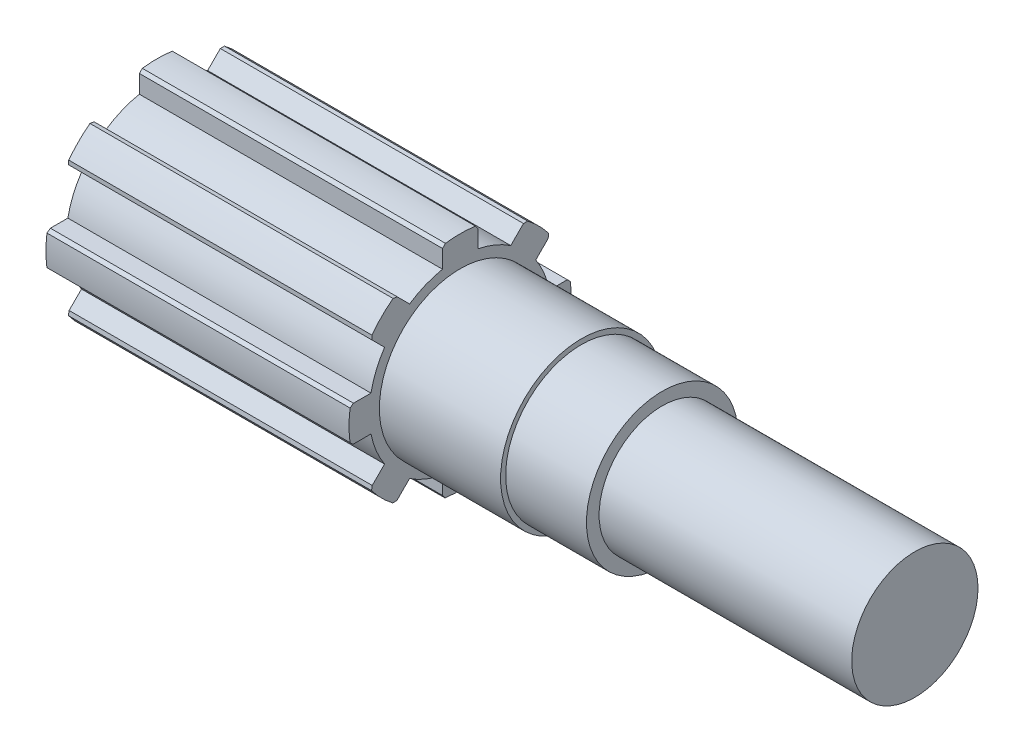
ISO-10303-21;
HEADER;
FILE_DESCRIPTION(('STEP AP214'),'2;1');
FILE_NAME('part.step','',(''),(''),'','','');
FILE_SCHEMA(('AUTOMOTIVE_DESIGN { 1 0 10303 214 1 1 1 1 }'));
ENDSEC;
DATA;
#1=APPLICATION_CONTEXT('core data for automotive mechanical design processes');
#2=APPLICATION_PROTOCOL_DEFINITION('international standard','automotive_design',2000,#1);
#3=PRODUCT_CONTEXT('',#1,'mechanical');
#4=PRODUCT('Part','Part','',(#3));
#5=PRODUCT_RELATED_PRODUCT_CATEGORY('part','',(#4));
#6=PRODUCT_DEFINITION_FORMATION('','',#4);
#7=PRODUCT_DEFINITION_CONTEXT('part definition',#1,'design');
#8=PRODUCT_DEFINITION('design','',#6,#7);
#9=PRODUCT_DEFINITION_SHAPE('','',#8);
#10=(LENGTH_UNIT() NAMED_UNIT(*) SI_UNIT(.MILLI.,.METRE.));
#11=(NAMED_UNIT(*) PLANE_ANGLE_UNIT() SI_UNIT($,.RADIAN.));
#12=(NAMED_UNIT(*) SI_UNIT($,.STERADIAN.) SOLID_ANGLE_UNIT());
#13=UNCERTAINTY_MEASURE_WITH_UNIT(LENGTH_MEASURE(1.E-05),#10,'distance_accuracy_value','');
#14=(GEOMETRIC_REPRESENTATION_CONTEXT(3) GLOBAL_UNCERTAINTY_ASSIGNED_CONTEXT((#13)) GLOBAL_UNIT_ASSIGNED_CONTEXT((#10,
#11,#12)) REPRESENTATION_CONTEXT('',''));
#15=CARTESIAN_POINT('',(0.,0.,0.));
#16=DIRECTION('',(0.,0.,1.));
#17=DIRECTION('',(1.,0.,0.));
#18=AXIS2_PLACEMENT_3D('',#15,#16,#17);
#19=CARTESIAN_POINT('',(0.,0.,0.));
#20=DIRECTION('',(1.,0.,0.));
#21=DIRECTION('',(0.,0.,-1.));
#22=AXIS2_PLACEMENT_3D('',#19,#20,#21);
#23=CYLINDRICAL_SURFACE('',#22,18.);
#24=DIRECTION('',(1.,0.,0.));
#25=VECTOR('',#24,1.);
#26=CARTESIAN_POINT('',(0.,10.010117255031,14.9598647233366));
#27=LINE('',#26,#25);
#28=CARTESIAN_POINT('',(0.,10.010117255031,14.9598647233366));
#29=VERTEX_POINT('',#28);
#30=CARTESIAN_POINT('',(60.,10.010117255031,14.9598647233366));
#31=VERTEX_POINT('',#30);
#32=EDGE_CURVE('E359',#29,#31,#27,.T.);
#33=ORIENTED_EDGE('',*,*,#32,.F.);
#34=CARTESIAN_POINT('',(0.,0.,0.));
#35=DIRECTION('',(1.,0.,0.));
#36=DIRECTION('',(0.,0.,-1.));
#37=AXIS2_PLACEMENT_3D('',#34,#35,#36);
#38=CIRCLE('',#37,18.);
#39=CARTESIAN_POINT('',(0.,3.50000000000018,17.6564435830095));
#40=VERTEX_POINT('',#39);
#41=EDGE_CURVE('E375',#29,#40,#38,.T.);
#42=ORIENTED_EDGE('',*,*,#41,.T.);
#43=DIRECTION('',(1.,0.,0.));
#44=VECTOR('',#43,1.);
#45=CARTESIAN_POINT('',(0.,3.50000000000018,17.6564435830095));
#46=LINE('',#45,#44);
#47=CARTESIAN_POINT('',(60.,3.50000000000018,17.6564435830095));
#48=VERTEX_POINT('',#47);
#49=EDGE_CURVE('E550',#40,#48,#46,.T.);
#50=ORIENTED_EDGE('',*,*,#49,.T.);
#51=CARTESIAN_POINT('',(60.,0.,0.));
#52=DIRECTION('',(1.,0.,0.));
#53=DIRECTION('',(0.,0.,-1.));
#54=AXIS2_PLACEMENT_3D('',#51,#52,#53);
#55=CIRCLE('',#54,18.);
#56=EDGE_CURVE('E391',#31,#48,#55,.T.);
#57=ORIENTED_EDGE('',*,*,#56,.F.);
#58=EDGE_LOOP('',(#33,#42,#50,#57));
#59=FACE_BOUND('',#58,.T.);
#60=ADVANCED_FACE('F41',(#59),#23,.T.);
#61=DIRECTION('',(1.,0.,0.));
#62=VECTOR('',#61,1.);
#63=CARTESIAN_POINT('',(0.,-3.49999999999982,17.6564435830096));
#64=LINE('',#63,#62);
#65=CARTESIAN_POINT('',(0.,-3.49999999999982,17.6564435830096));
#66=VERTEX_POINT('',#65);
#67=CARTESIAN_POINT('',(60.,-3.49999999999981,17.6564435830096));
#68=VERTEX_POINT('',#67);
#69=EDGE_CURVE('E543',#66,#68,#64,.T.);
#70=ORIENTED_EDGE('',*,*,#69,.F.);
#71=CARTESIAN_POINT('',(0.,-10.0101172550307,14.9598647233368));
#72=VERTEX_POINT('',#71);
#73=EDGE_CURVE('E381',#66,#72,#38,.T.);
#74=ORIENTED_EDGE('',*,*,#73,.T.);
#75=DIRECTION('',(1.,0.,0.));
#76=VECTOR('',#75,1.);
#77=CARTESIAN_POINT('',(0.,-10.0101172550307,14.9598647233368));
#78=LINE('',#77,#76);
#79=CARTESIAN_POINT('',(60.,-10.0101172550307,14.9598647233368));
#80=VERTEX_POINT('',#79);
#81=EDGE_CURVE('E528',#72,#80,#78,.T.);
#82=ORIENTED_EDGE('',*,*,#81,.T.);
#83=EDGE_CURVE('E394',#68,#80,#55,.T.);
#84=ORIENTED_EDGE('',*,*,#83,.F.);
#85=EDGE_LOOP('',(#70,#74,#82,#84));
#86=FACE_BOUND('',#85,.T.);
#87=ADVANCED_FACE('F812',(#86),#23,.T.);
#88=DIRECTION('',(1.,0.,0.));
#89=VECTOR('',#88,1.);
#90=CARTESIAN_POINT('',(0.,-14.9598647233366,10.010117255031));
#91=LINE('',#90,#89);
#92=CARTESIAN_POINT('',(0.,-14.9598647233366,10.010117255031));
#93=VERTEX_POINT('',#92);
#94=CARTESIAN_POINT('',(60.,-14.9598647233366,10.010117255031));
#95=VERTEX_POINT('',#94);
#96=EDGE_CURVE('E521',#93,#95,#91,.T.);
#97=ORIENTED_EDGE('',*,*,#96,.F.);
#98=CARTESIAN_POINT('',(0.,-17.6564435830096,3.5));
#99=VERTEX_POINT('',#98);
#100=EDGE_CURVE('E799',#93,#99,#38,.T.);
#101=ORIENTED_EDGE('',*,*,#100,.T.);
#102=DIRECTION('',(1.,0.,0.));
#103=VECTOR('',#102,1.);
#104=CARTESIAN_POINT('',(0.,-17.6564435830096,3.5));
#105=LINE('',#104,#103);
#106=CARTESIAN_POINT('',(60.,-17.6564435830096,3.5));
#107=VERTEX_POINT('',#106);
#108=EDGE_CURVE('E506',#99,#107,#105,.T.);
#109=ORIENTED_EDGE('',*,*,#108,.T.);
#110=EDGE_CURVE('E827',#95,#107,#55,.T.);
#111=ORIENTED_EDGE('',*,*,#110,.F.);
#112=EDGE_LOOP('',(#97,#101,#109,#111));
#113=FACE_BOUND('',#112,.T.);
#114=ADVANCED_FACE('F884',(#113),#23,.T.);
#115=DIRECTION('',(1.,0.,0.));
#116=VECTOR('',#115,1.);
#117=CARTESIAN_POINT('',(0.,-17.6564435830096,-3.5));
#118=LINE('',#117,#116);
#119=CARTESIAN_POINT('',(0.,-17.6564435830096,-3.5));
#120=VERTEX_POINT('',#119);
#121=CARTESIAN_POINT('',(60.,-17.6564435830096,-3.5));
#122=VERTEX_POINT('',#121);
#123=EDGE_CURVE('E499',#120,#122,#118,.T.);
#124=ORIENTED_EDGE('',*,*,#123,.F.);
#125=CARTESIAN_POINT('',(0.,-14.9598647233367,-10.0101172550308));
#126=VERTEX_POINT('',#125);
#127=EDGE_CURVE('E798',#120,#126,#38,.T.);
#128=ORIENTED_EDGE('',*,*,#127,.T.);
#129=DIRECTION('',(1.,0.,0.));
#130=VECTOR('',#129,1.);
#131=CARTESIAN_POINT('',(0.,-14.9598647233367,-10.0101172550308));
#132=LINE('',#131,#130);
#133=CARTESIAN_POINT('',(60.,-14.9598647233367,-10.0101172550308));
#134=VERTEX_POINT('',#133);
#135=EDGE_CURVE('E484',#126,#134,#132,.T.);
#136=ORIENTED_EDGE('',*,*,#135,.T.);
#137=EDGE_CURVE('E828',#122,#134,#55,.T.);
#138=ORIENTED_EDGE('',*,*,#137,.F.);
#139=EDGE_LOOP('',(#124,#128,#136,#138));
#140=FACE_BOUND('',#139,.T.);
#141=ADVANCED_FACE('F886',(#140),#23,.T.);
#142=DIRECTION('',(1.,0.,0.));
#143=VECTOR('',#142,1.);
#144=CARTESIAN_POINT('',(0.,-10.0101172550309,-14.9598647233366));
#145=LINE('',#144,#143);
#146=CARTESIAN_POINT('',(0.,-10.0101172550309,-14.9598647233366));
#147=VERTEX_POINT('',#146);
#148=CARTESIAN_POINT('',(60.,-10.0101172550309,-14.9598647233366));
#149=VERTEX_POINT('',#148);
#150=EDGE_CURVE('E477',#147,#149,#145,.T.);
#151=ORIENTED_EDGE('',*,*,#150,.F.);
#152=CARTESIAN_POINT('',(0.,-3.50000000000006,-17.6564435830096));
#153=VERTEX_POINT('',#152);
#154=EDGE_CURVE('E390',#147,#153,#38,.T.);
#155=ORIENTED_EDGE('',*,*,#154,.T.);
#156=DIRECTION('',(1.,0.,0.));
#157=VECTOR('',#156,1.);
#158=CARTESIAN_POINT('',(0.,-3.50000000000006,-17.6564435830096));
#159=LINE('',#158,#157);
#160=CARTESIAN_POINT('',(60.,-3.50000000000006,-17.6564435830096));
#161=VERTEX_POINT('',#160);
#162=EDGE_CURVE('E462',#153,#161,#159,.T.);
#163=ORIENTED_EDGE('',*,*,#162,.T.);
#164=EDGE_CURVE('E401',#149,#161,#55,.T.);
#165=ORIENTED_EDGE('',*,*,#164,.F.);
#166=EDGE_LOOP('',(#151,#155,#163,#165));
#167=FACE_BOUND('',#166,.T.);
#168=ADVANCED_FACE('F796',(#167),#23,.T.);
#169=DIRECTION('',(1.,0.,0.));
#170=VECTOR('',#169,1.);
#171=CARTESIAN_POINT('',(0.,3.49999999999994,-17.6564435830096));
#172=LINE('',#171,#170);
#173=CARTESIAN_POINT('',(0.,3.49999999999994,-17.6564435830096));
#174=VERTEX_POINT('',#173);
#175=CARTESIAN_POINT('',(60.,3.49999999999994,-17.6564435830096));
#176=VERTEX_POINT('',#175);
#177=EDGE_CURVE('E455',#174,#176,#172,.T.);
#178=ORIENTED_EDGE('',*,*,#177,.F.);
#179=CARTESIAN_POINT('',(0.,10.0101172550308,-14.9598647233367));
#180=VERTEX_POINT('',#179);
#181=EDGE_CURVE('E383',#174,#180,#38,.T.);
#182=ORIENTED_EDGE('',*,*,#181,.T.);
#183=DIRECTION('',(1.,0.,0.));
#184=VECTOR('',#183,1.);
#185=CARTESIAN_POINT('',(0.,10.0101172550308,-14.9598647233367));
#186=LINE('',#185,#184);
#187=CARTESIAN_POINT('',(60.,10.0101172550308,-14.9598647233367));
#188=VERTEX_POINT('',#187);
#189=EDGE_CURVE('E440',#180,#188,#186,.T.);
#190=ORIENTED_EDGE('',*,*,#189,.T.);
#191=EDGE_CURVE('E396',#176,#188,#55,.T.);
#192=ORIENTED_EDGE('',*,*,#191,.F.);
#193=EDGE_LOOP('',(#178,#182,#190,#192));
#194=FACE_BOUND('',#193,.T.);
#195=ADVANCED_FACE('F769',(#194),#23,.T.);
#196=DIRECTION('',(1.,0.,0.));
#197=VECTOR('',#196,1.);
#198=CARTESIAN_POINT('',(0.,14.9598647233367,-10.0101172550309));
#199=LINE('',#198,#197);
#200=CARTESIAN_POINT('',(0.,14.9598647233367,-10.0101172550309));
#201=VERTEX_POINT('',#200);
#202=CARTESIAN_POINT('',(60.,14.9598647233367,-10.0101172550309));
#203=VERTEX_POINT('',#202);
#204=EDGE_CURVE('E433',#201,#203,#199,.T.);
#205=ORIENTED_EDGE('',*,*,#204,.F.);
#206=CARTESIAN_POINT('',(0.,17.6564435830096,-3.5));
#207=VERTEX_POINT('',#206);
#208=EDGE_CURVE('E377',#201,#207,#38,.T.);
#209=ORIENTED_EDGE('',*,*,#208,.T.);
#210=DIRECTION('',(1.,0.,0.));
#211=VECTOR('',#210,1.);
#212=CARTESIAN_POINT('',(0.,17.6564435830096,-3.5));
#213=LINE('',#212,#211);
#214=CARTESIAN_POINT('',(60.,17.6564435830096,-3.5));
#215=VERTEX_POINT('',#214);
#216=EDGE_CURVE('E421',#207,#215,#213,.T.);
#217=ORIENTED_EDGE('',*,*,#216,.T.);
#218=EDGE_CURVE('E392',#203,#215,#55,.T.);
#219=ORIENTED_EDGE('',*,*,#218,.F.);
#220=EDGE_LOOP('',(#205,#209,#217,#219));
#221=FACE_BOUND('',#220,.T.);
#222=ADVANCED_FACE('F741',(#221),#23,.T.);
#223=CARTESIAN_POINT('',(0.,0.,0.));
#224=DIRECTION('',(-1.,0.,0.));
#225=DIRECTION('',(0.,0.,1.));
#226=AXIS2_PLACEMENT_3D('',#223,#224,#225);
#227=PLANE('',#226);
#228=CARTESIAN_POINT('',(0.,0.,0.));
#229=DIRECTION('',(1.,0.,0.));
#230=DIRECTION('',(0.,0.707106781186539,-0.707106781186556));
#231=AXIS2_PLACEMENT_3D('',#228,#229,#230);
#232=CIRCLE('',#231,22.);
#233=CARTESIAN_POINT('',(0.,17.5390426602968,13.2808878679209));
#234=VERTEX_POINT('',#233);
#235=CARTESIAN_POINT('',(0.,13.3591010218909,17.4795428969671));
#236=VERTEX_POINT('',#235);
#237=EDGE_CURVE('E367',#234,#236,#232,.T.);
#238=ORIENTED_EDGE('',*,*,#237,.F.);
#239=DIRECTION('',(0.,0.159090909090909,0.987263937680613));
#240=VECTOR('',#239,1.);
#241=CARTESIAN_POINT('',(0.,15.0091720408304,-2.41862660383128));
#242=LINE('',#241,#240);
#243=CARTESIAN_POINT('',(0.,17.4061886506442,12.456441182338));
#244=VERTEX_POINT('',#243);
#245=EDGE_CURVE('E50',#234,#244,#242,.F.);
#246=ORIENTED_EDGE('',*,*,#245,.T.);
#247=DIRECTION('',(0.,0.707106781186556,0.707106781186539));
#248=VECTOR('',#247,1.);
#249=CARTESIAN_POINT('',(0.,14.9598647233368,10.0101172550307));
#250=LINE('',#249,#248);
#251=CARTESIAN_POINT('',(0.,14.9598647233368,10.0101172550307));
#252=VERTEX_POINT('',#251);
#253=EDGE_CURVE('E351',#252,#244,#250,.T.);
#254=ORIENTED_EDGE('',*,*,#253,.F.);
#255=CARTESIAN_POINT('',(0.,17.6564435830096,3.5));
#256=VERTEX_POINT('',#255);
#257=EDGE_CURVE('E365',#256,#252,#38,.T.);
#258=ORIENTED_EDGE('',*,*,#257,.F.);
#259=DIRECTION('',(0.,-1.,0.));
#260=VECTOR('',#259,1.);
#261=CARTESIAN_POINT('',(0.,21.7198066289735,3.5));
#262=LINE('',#261,#260);
#263=CARTESIAN_POINT('',(0.,21.2198066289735,3.5));
#264=VERTEX_POINT('',#263);
#265=EDGE_CURVE('E423',#264,#256,#262,.T.);
#266=ORIENTED_EDGE('',*,*,#265,.F.);
#267=DIRECTION('',(0.,-0.707106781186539,0.707106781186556));
#268=VECTOR('',#267,1.);
#269=CARTESIAN_POINT('',(0.,12.359903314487,12.3599033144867));
#270=LINE('',#269,#268);
#271=CARTESIAN_POINT('',(0.,21.8062142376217,2.91359239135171));
#272=VERTEX_POINT('',#271);
#273=EDGE_CURVE('E710',#264,#272,#270,.F.);
#274=ORIENTED_EDGE('',*,*,#273,.T.);
#275=CARTESIAN_POINT('',(0.,0.,0.));
#276=DIRECTION('',(1.,0.,0.));
#277=DIRECTION('',(0.,0.,-1.));
#278=AXIS2_PLACEMENT_3D('',#275,#276,#277);
#279=CIRCLE('',#278,22.);
#280=CARTESIAN_POINT('',(0.,21.7929818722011,-3.01097012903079));
#281=VERTEX_POINT('',#280);
#282=EDGE_CURVE('E435',#281,#272,#279,.T.);
#283=ORIENTED_EDGE('',*,*,#282,.F.);
#284=DIRECTION('',(0.,0.81059528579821,0.585606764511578));
#285=VECTOR('',#284,1.);
#286=CARTESIAN_POINT('',(0.,8.90286005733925,-12.3233146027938));
#287=LINE('',#286,#285);
#288=CARTESIAN_POINT('',(0.,21.1160680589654,-3.5));
#289=VERTEX_POINT('',#288);
#290=EDGE_CURVE('E708',#281,#289,#287,.F.);
#291=ORIENTED_EDGE('',*,*,#290,.T.);
#292=DIRECTION('',(0.,1.,0.));
#293=VECTOR('',#292,1.);
#294=CARTESIAN_POINT('',(0.,17.6564435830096,-3.5));
#295=LINE('',#294,#293);
#296=EDGE_CURVE('E427',#207,#289,#295,.T.);
#297=ORIENTED_EDGE('',*,*,#296,.F.);
#298=ORIENTED_EDGE('',*,*,#208,.F.);
#299=DIRECTION('',(0.,-0.707106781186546,0.707106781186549));
#300=VECTOR('',#299,1.);
#301=CARTESIAN_POINT('',(0.,17.8330962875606,-12.8833488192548));
#302=LINE('',#301,#300);
#303=CARTESIAN_POINT('',(0.,17.4795428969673,-12.5297954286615));
#304=VERTEX_POINT('',#303);
#305=EDGE_CURVE('E443',#304,#201,#302,.T.);
#306=ORIENTED_EDGE('',*,*,#305,.F.);
#307=DIRECTION('',(0.,0.,1.));
#308=VECTOR('',#307,1.);
#309=CARTESIAN_POINT('',(0.,17.4795428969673,0.));
#310=LINE('',#309,#308);
#311=CARTESIAN_POINT('',(0.,17.4795428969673,-13.3591010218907));
#312=VERTEX_POINT('',#311);
#313=EDGE_CURVE('E692',#304,#312,#310,.F.);
#314=ORIENTED_EDGE('',*,*,#313,.T.);
#315=CARTESIAN_POINT('',(0.,0.,0.));
#316=DIRECTION('',(1.,0.,0.));
#317=DIRECTION('',(0.,-0.707106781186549,-0.707106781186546));
#318=AXIS2_PLACEMENT_3D('',#315,#316,#317);
#319=CIRCLE('',#318,22.);
#320=CARTESIAN_POINT('',(0.,13.280887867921,-17.5390426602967));
#321=VERTEX_POINT('',#320);
#322=EDGE_CURVE('E457',#321,#312,#319,.T.);
#323=ORIENTED_EDGE('',*,*,#322,.F.);
#324=DIRECTION('',(0.,0.987263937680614,-0.159090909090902));
#325=VECTOR('',#324,1.);
#326=CARTESIAN_POINT('',(0.,-2.41862660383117,-15.0091720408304));
#327=LINE('',#326,#325);
#328=CARTESIAN_POINT('',(0.,12.4564411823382,-17.406188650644));
#329=VERTEX_POINT('',#328);
#330=EDGE_CURVE('E690',#321,#329,#327,.F.);
#331=ORIENTED_EDGE('',*,*,#330,.T.);
#332=DIRECTION('',(0.,0.707106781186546,-0.707106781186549));
#333=VECTOR('',#332,1.);
#334=CARTESIAN_POINT('',(0.,10.0101172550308,-14.9598647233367));
#335=LINE('',#334,#333);
#336=EDGE_CURVE('E448',#180,#329,#335,.T.);
#337=ORIENTED_EDGE('',*,*,#336,.F.);
#338=ORIENTED_EDGE('',*,*,#181,.F.);
#339=DIRECTION('',(0.,0.,1.));
#340=VECTOR('',#339,1.);
#341=CARTESIAN_POINT('',(0.,3.49999999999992,-21.7198066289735));
#342=LINE('',#341,#340);
#343=CARTESIAN_POINT('',(0.,3.49999999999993,-21.2198066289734));
#344=VERTEX_POINT('',#343);
#345=EDGE_CURVE('E465',#344,#174,#342,.T.);
#346=ORIENTED_EDGE('',*,*,#345,.F.);
#347=DIRECTION('',(0.,0.707106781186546,0.707106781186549));
#348=VECTOR('',#347,1.);
#349=CARTESIAN_POINT('',(0.,12.3599033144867,-12.3599033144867));
#350=LINE('',#349,#348);
#351=CARTESIAN_POINT('',(0.,2.9135923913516,-21.8062142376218));
#352=VERTEX_POINT('',#351);
#353=EDGE_CURVE('E674',#344,#352,#350,.F.);
#354=ORIENTED_EDGE('',*,*,#353,.T.);
#355=CARTESIAN_POINT('',(0.,0.,0.));
#356=DIRECTION('',(1.,0.,0.));
#357=DIRECTION('',(0.,-1.,0.));
#358=AXIS2_PLACEMENT_3D('',#355,#356,#357);
#359=CIRCLE('',#358,22.);
#360=CARTESIAN_POINT('',(0.,-3.01097012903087,-21.7929818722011));
#361=VERTEX_POINT('',#360);
#362=EDGE_CURVE('E479',#361,#352,#359,.T.);
#363=ORIENTED_EDGE('',*,*,#362,.F.);
#364=DIRECTION('',(0.,0.585606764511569,-0.810595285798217));
#365=VECTOR('',#364,1.);
#366=CARTESIAN_POINT('',(0.,-12.3233146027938,-8.90286005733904));
#367=LINE('',#366,#365);
#368=CARTESIAN_POINT('',(0.,-3.50000000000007,-21.1160680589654));
#369=VERTEX_POINT('',#368);
#370=EDGE_CURVE('E672',#361,#369,#367,.F.);
#371=ORIENTED_EDGE('',*,*,#370,.T.);
#372=DIRECTION('',(0.,0.,-1.));
#373=VECTOR('',#372,1.);
#374=CARTESIAN_POINT('',(0.,-3.50000000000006,-17.6564435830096));
#375=LINE('',#374,#373);
#376=EDGE_CURVE('E470',#153,#369,#375,.T.);
#377=ORIENTED_EDGE('',*,*,#376,.F.);
#378=ORIENTED_EDGE('',*,*,#154,.F.);
#379=DIRECTION('',(0.,0.707106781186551,0.707106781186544));
#380=VECTOR('',#379,1.);
#381=CARTESIAN_POINT('',(0.,-12.8833488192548,-17.8330962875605));
#382=LINE('',#381,#380);
#383=CARTESIAN_POINT('',(0.,-12.5297954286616,-17.4795428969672));
#384=VERTEX_POINT('',#383);
#385=EDGE_CURVE('E487',#384,#147,#382,.T.);
#386=ORIENTED_EDGE('',*,*,#385,.F.);
#387=DIRECTION('',(0.,1.,0.));
#388=VECTOR('',#387,1.);
#389=CARTESIAN_POINT('',(0.,0.,-17.4795428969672));
#390=LINE('',#389,#388);
#391=CARTESIAN_POINT('',(0.,-13.3591010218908,-17.4795428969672));
#392=VERTEX_POINT('',#391);
#393=EDGE_CURVE('E656',#384,#392,#390,.F.);
#394=ORIENTED_EDGE('',*,*,#393,.T.);
#395=CARTESIAN_POINT('',(0.,0.,0.));
#396=DIRECTION('',(1.,0.,0.));
#397=DIRECTION('',(0.,-0.707106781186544,0.707106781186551));
#398=AXIS2_PLACEMENT_3D('',#395,#396,#397);
#399=CIRCLE('',#398,22.);
#400=CARTESIAN_POINT('',(0.,-17.5390426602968,-13.2808878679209));
#401=VERTEX_POINT('',#400);
#402=EDGE_CURVE('E501',#401,#392,#399,.T.);
#403=ORIENTED_EDGE('',*,*,#402,.F.);
#404=DIRECTION('',(0.,-0.159090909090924,-0.98726393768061));
#405=VECTOR('',#404,1.);
#406=CARTESIAN_POINT('',(0.,-15.0091720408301,2.41862660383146));
#407=LINE('',#406,#405);
#408=CARTESIAN_POINT('',(0.,-17.4061886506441,-12.4564411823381));
#409=VERTEX_POINT('',#408);
#410=EDGE_CURVE('E654',#401,#409,#407,.F.);
#411=ORIENTED_EDGE('',*,*,#410,.T.);
#412=DIRECTION('',(0.,-0.707106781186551,-0.707106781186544));
#413=VECTOR('',#412,1.);
#414=CARTESIAN_POINT('',(0.,-14.9598647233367,-10.0101172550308));
#415=LINE('',#414,#413);
#416=EDGE_CURVE('E492',#126,#409,#415,.T.);
#417=ORIENTED_EDGE('',*,*,#416,.F.);
#418=ORIENTED_EDGE('',*,*,#127,.F.);
#419=DIRECTION('',(0.,1.,0.));
#420=VECTOR('',#419,1.);
#421=CARTESIAN_POINT('',(0.,-21.7198066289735,-3.5));
#422=LINE('',#421,#420);
#423=CARTESIAN_POINT('',(0.,-21.2198066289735,-3.5));
#424=VERTEX_POINT('',#423);
#425=EDGE_CURVE('E509',#424,#120,#422,.T.);
#426=ORIENTED_EDGE('',*,*,#425,.F.);
#427=DIRECTION('',(0.,0.707106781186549,-0.707106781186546));
#428=VECTOR('',#427,1.);
#429=CARTESIAN_POINT('',(0.,-12.3599033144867,-12.3599033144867));
#430=LINE('',#429,#428);
#431=CARTESIAN_POINT('',(0.,-21.8062142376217,-2.91359239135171));
#432=VERTEX_POINT('',#431);
#433=EDGE_CURVE('E638',#424,#432,#430,.F.);
#434=ORIENTED_EDGE('',*,*,#433,.T.);
#435=CARTESIAN_POINT('',(0.,0.,0.));
#436=DIRECTION('',(1.,0.,0.));
#437=DIRECTION('',(0.,0.,1.));
#438=AXIS2_PLACEMENT_3D('',#435,#436,#437);
#439=CIRCLE('',#438,22.);
#440=CARTESIAN_POINT('',(0.,-21.7929818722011,3.01097012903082));
#441=VERTEX_POINT('',#440);
#442=EDGE_CURVE('E523',#441,#432,#439,.T.);
#443=ORIENTED_EDGE('',*,*,#442,.F.);
#444=DIRECTION('',(0.,-0.810595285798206,-0.585606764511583));
#445=VECTOR('',#444,1.);
#446=CARTESIAN_POINT('',(0.,-8.90286005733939,12.3233146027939));
#447=LINE('',#446,#445);
#448=CARTESIAN_POINT('',(0.,-21.1160680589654,3.5));
#449=VERTEX_POINT('',#448);
#450=EDGE_CURVE('E636',#441,#449,#447,.F.);
#451=ORIENTED_EDGE('',*,*,#450,.T.);
#452=DIRECTION('',(0.,-1.,0.));
#453=VECTOR('',#452,1.);
#454=CARTESIAN_POINT('',(0.,-17.6564435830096,3.5));
#455=LINE('',#454,#453);
#456=EDGE_CURVE('E514',#99,#449,#455,.T.);
#457=ORIENTED_EDGE('',*,*,#456,.F.);
#458=ORIENTED_EDGE('',*,*,#100,.F.);
#459=DIRECTION('',(0.,0.707106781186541,-0.707106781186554));
#460=VECTOR('',#459,1.);
#461=CARTESIAN_POINT('',(0.,-17.8330962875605,12.8833488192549));
#462=LINE('',#461,#460);
#463=CARTESIAN_POINT('',(0.,-17.4795428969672,12.5297954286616));
#464=VERTEX_POINT('',#463);
#465=EDGE_CURVE('E531',#464,#93,#462,.T.);
#466=ORIENTED_EDGE('',*,*,#465,.F.);
#467=DIRECTION('',(0.,0.,-1.));
#468=VECTOR('',#467,1.);
#469=CARTESIAN_POINT('',(0.,-17.4795428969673,1.46253316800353E-13));
#470=LINE('',#469,#468);
#471=CARTESIAN_POINT('',(0.,-17.4795428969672,13.3591010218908));
#472=VERTEX_POINT('',#471);
#473=EDGE_CURVE('E620',#464,#472,#470,.F.);
#474=ORIENTED_EDGE('',*,*,#473,.T.);
#475=CARTESIAN_POINT('',(0.,0.,0.));
#476=DIRECTION('',(1.,0.,0.));
#477=DIRECTION('',(0.,0.707106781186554,0.707106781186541));
#478=AXIS2_PLACEMENT_3D('',#475,#476,#477);
#479=CIRCLE('',#478,22.);
#480=CARTESIAN_POINT('',(0.,-13.2808878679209,17.5390426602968));
#481=VERTEX_POINT('',#480);
#482=EDGE_CURVE('E545',#481,#472,#479,.T.);
#483=ORIENTED_EDGE('',*,*,#482,.F.);
#484=DIRECTION('',(0.,-0.987263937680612,0.159090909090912));
#485=VECTOR('',#484,1.);
#486=CARTESIAN_POINT('',(0.,2.41862660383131,15.0091720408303));
#487=LINE('',#486,#485);
#488=CARTESIAN_POINT('',(0.,-12.456441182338,17.4061886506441));
#489=VERTEX_POINT('',#488);
#490=EDGE_CURVE('E618',#481,#489,#487,.F.);
#491=ORIENTED_EDGE('',*,*,#490,.T.);
#492=DIRECTION('',(0.,-0.707106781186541,0.707106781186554));
#493=VECTOR('',#492,1.);
#494=CARTESIAN_POINT('',(0.,-10.0101172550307,14.9598647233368));
#495=LINE('',#494,#493);
#496=EDGE_CURVE('E536',#72,#489,#495,.T.);
#497=ORIENTED_EDGE('',*,*,#496,.F.);
#498=ORIENTED_EDGE('',*,*,#73,.F.);
#499=DIRECTION('',(0.,0.,-1.));
#500=VECTOR('',#499,1.);
#501=CARTESIAN_POINT('',(0.,-3.49999999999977,21.7198066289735));
#502=LINE('',#501,#500);
#503=CARTESIAN_POINT('',(0.,-3.49999999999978,21.2198066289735));
#504=VERTEX_POINT('',#503);
#505=EDGE_CURVE('E553',#504,#66,#502,.T.);
#506=ORIENTED_EDGE('',*,*,#505,.F.);
#507=DIRECTION('',(0.,-0.707106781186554,-0.707106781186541));
#508=VECTOR('',#507,1.);
#509=CARTESIAN_POINT('',(0.,-12.3599033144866,12.3599033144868));
#510=LINE('',#509,#508);
#511=CARTESIAN_POINT('',(0.,-2.9135923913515,21.8062142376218));
#512=VERTEX_POINT('',#511);
#513=EDGE_CURVE('E602',#504,#512,#510,.F.);
#514=ORIENTED_EDGE('',*,*,#513,.T.);
#515=CARTESIAN_POINT('',(0.,0.,0.));
#516=DIRECTION('',(1.,0.,0.));
#517=DIRECTION('',(0.,1.,0.));
#518=AXIS2_PLACEMENT_3D('',#515,#516,#517);
#519=CIRCLE('',#518,22.);
#520=CARTESIAN_POINT('',(0.,3.01097012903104,21.792981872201));
#521=VERTEX_POINT('',#520);
#522=EDGE_CURVE('E566',#521,#512,#519,.T.);
#523=ORIENTED_EDGE('',*,*,#522,.F.);
#524=DIRECTION('',(0.,-0.585606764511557,0.810595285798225));
#525=VECTOR('',#524,1.);
#526=CARTESIAN_POINT('',(0.,12.3233146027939,8.9028600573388));
#527=LINE('',#526,#525);
#528=CARTESIAN_POINT('',(0.,3.50000000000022,21.1160680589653));
#529=VERTEX_POINT('',#528);
#530=EDGE_CURVE('E600',#521,#529,#527,.F.);
#531=ORIENTED_EDGE('',*,*,#530,.T.);
#532=DIRECTION('',(0.,0.,1.));
#533=VECTOR('',#532,1.);
#534=CARTESIAN_POINT('',(0.,3.50000000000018,17.6564435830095));
#535=LINE('',#534,#533);
#536=EDGE_CURVE('E558',#40,#529,#535,.T.);
#537=ORIENTED_EDGE('',*,*,#536,.F.);
#538=ORIENTED_EDGE('',*,*,#41,.F.);
#539=DIRECTION('',(0.,-0.707106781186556,-0.707106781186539));
#540=VECTOR('',#539,1.);
#541=CARTESIAN_POINT('',(0.,12.883348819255,17.8330962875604));
#542=LINE('',#541,#540);
#543=CARTESIAN_POINT('',(0.,12.5297954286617,17.4795428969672));
#544=VERTEX_POINT('',#543);
#545=EDGE_CURVE('E360',#544,#29,#542,.T.);
#546=ORIENTED_EDGE('',*,*,#545,.F.);
#547=DIRECTION('',(0.,-1.,0.));
#548=VECTOR('',#547,1.);
#549=CARTESIAN_POINT('',(0.,2.9250663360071E-13,17.4795428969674));
#550=LINE('',#549,#548);
#551=EDGE_CURVE('E62',#544,#236,#550,.F.);
#552=ORIENTED_EDGE('',*,*,#551,.T.);
#553=EDGE_LOOP('',(#238,#246,#254,#258,#266,#274,#283,#291,#297,#298,#306,#314,#323,#331,#337,
#338,#346,#354,#363,#371,#377,#378,#386,#394,#403,#411,#417,#418,#426,#434,#443,#451,#457,#458,
#466,#474,#483,#491,#497,#498,#506,#514,#523,#531,#537,#538,#546,#552));
#554=FACE_BOUND('',#553,.T.);
#555=ADVANCED_FACE('F363',(#554),#227,.T.);
#556=DIRECTION('',(1.,0.,0.));
#557=VECTOR('',#556,1.);
#558=CARTESIAN_POINT('',(0.,14.9598647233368,10.0101172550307));
#559=LINE('',#558,#557);
#560=CARTESIAN_POINT('',(60.,14.9598647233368,10.0101172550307));
#561=VERTEX_POINT('',#560);
#562=EDGE_CURVE('E347',#252,#561,#559,.T.);
#563=ORIENTED_EDGE('',*,*,#562,.T.);
#564=CARTESIAN_POINT('',(60.,17.6564435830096,3.5));
#565=VERTEX_POINT('',#564);
#566=EDGE_CURVE('E384',#565,#561,#55,.T.);
#567=ORIENTED_EDGE('',*,*,#566,.F.);
#568=DIRECTION('',(1.,0.,0.));
#569=VECTOR('',#568,1.);
#570=CARTESIAN_POINT('',(0.,17.6564435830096,3.5));
#571=LINE('',#570,#569);
#572=EDGE_CURVE('E373',#256,#565,#571,.T.);
#573=ORIENTED_EDGE('',*,*,#572,.F.);
#574=ORIENTED_EDGE('',*,*,#257,.T.);
#575=EDGE_LOOP('',(#563,#567,#573,#574));
#576=FACE_BOUND('',#575,.T.);
#577=ADVANCED_FACE('F371',(#576),#23,.T.);
#578=CARTESIAN_POINT('',(60.,18.,0.));
#579=DIRECTION('',(1.,0.,0.));
#580=DIRECTION('',(0.,0.,-1.));
#581=AXIS2_PLACEMENT_3D('',#578,#579,#580);
#582=PLANE('',#581);
#583=DIRECTION('',(0.,0.707106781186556,0.707106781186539));
#584=VECTOR('',#583,1.);
#585=CARTESIAN_POINT('',(60.,14.9598647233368,10.0101172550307));
#586=LINE('',#585,#584);
#587=CARTESIAN_POINT('',(60.,17.4061886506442,12.456441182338));
#588=VERTEX_POINT('',#587);
#589=EDGE_CURVE('E354',#561,#588,#586,.T.);
#590=ORIENTED_EDGE('',*,*,#589,.T.);
#591=DIRECTION('',(0.,-0.159090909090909,-0.987263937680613));
#592=VECTOR('',#591,1.);
#593=CARTESIAN_POINT('',(60.,15.4647505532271,0.408538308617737));
#594=LINE('',#593,#592);
#595=CARTESIAN_POINT('',(60.,17.5390426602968,13.2808878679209));
#596=VERTEX_POINT('',#595);
#597=EDGE_CURVE('E589',#588,#596,#594,.F.);
#598=ORIENTED_EDGE('',*,*,#597,.T.);
#599=CARTESIAN_POINT('',(60.,0.,0.));
#600=DIRECTION('',(1.,0.,0.));
#601=DIRECTION('',(0.,0.707106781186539,-0.707106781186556));
#602=AXIS2_PLACEMENT_3D('',#599,#600,#601);
#603=CIRCLE('',#602,22.);
#604=CARTESIAN_POINT('',(60.,13.3591010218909,17.4795428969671));
#605=VERTEX_POINT('',#604);
#606=EDGE_CURVE('E574',#596,#605,#603,.T.);
#607=ORIENTED_EDGE('',*,*,#606,.T.);
#608=DIRECTION('',(0.,1.,0.));
#609=VECTOR('',#608,1.);
#610=CARTESIAN_POINT('',(60.,18.0000000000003,17.4795428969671));
#611=LINE('',#610,#609);
#612=CARTESIAN_POINT('',(60.,12.5297954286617,17.4795428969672));
#613=VERTEX_POINT('',#612);
#614=EDGE_CURVE('E588',#605,#613,#611,.F.);
#615=ORIENTED_EDGE('',*,*,#614,.T.);
#616=DIRECTION('',(0.,-0.707106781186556,-0.707106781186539));
#617=VECTOR('',#616,1.);
#618=CARTESIAN_POINT('',(60.,12.883348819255,17.8330962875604));
#619=LINE('',#618,#617);
#620=EDGE_CURVE('E368',#613,#31,#619,.T.);
#621=ORIENTED_EDGE('',*,*,#620,.T.);
#622=ORIENTED_EDGE('',*,*,#56,.T.);
#623=DIRECTION('',(0.,0.,1.));
#624=VECTOR('',#623,1.);
#625=CARTESIAN_POINT('',(60.,3.50000000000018,17.6564435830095));
#626=LINE('',#625,#624);
#627=CARTESIAN_POINT('',(60.,3.50000000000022,21.1160680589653));
#628=VERTEX_POINT('',#627);
#629=EDGE_CURVE('E562',#48,#628,#626,.T.);
#630=ORIENTED_EDGE('',*,*,#629,.T.);
#631=DIRECTION('',(0.,0.585606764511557,-0.810595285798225));
#632=VECTOR('',#631,1.);
#633=CARTESIAN_POINT('',(60.,18.4961496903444,0.358438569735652));
#634=LINE('',#633,#632);
#635=CARTESIAN_POINT('',(60.,3.01097012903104,21.792981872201));
#636=VERTEX_POINT('',#635);
#637=EDGE_CURVE('E609',#628,#636,#634,.F.);
#638=ORIENTED_EDGE('',*,*,#637,.T.);
#639=CARTESIAN_POINT('',(60.,0.,0.));
#640=DIRECTION('',(1.,0.,0.));
#641=DIRECTION('',(0.,1.,0.));
#642=AXIS2_PLACEMENT_3D('',#639,#640,#641);
#643=CIRCLE('',#642,22.);
#644=CARTESIAN_POINT('',(60.,-2.9135923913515,21.8062142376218));
#645=VERTEX_POINT('',#644);
#646=EDGE_CURVE('E559',#636,#645,#643,.T.);
#647=ORIENTED_EDGE('',*,*,#646,.T.);
#648=DIRECTION('',(0.,0.707106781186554,0.707106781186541));
#649=VECTOR('',#648,1.);
#650=CARTESIAN_POINT('',(60.,-3.35990331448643,21.3599033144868));
#651=LINE('',#650,#649);
#652=CARTESIAN_POINT('',(60.,-3.49999999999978,21.2198066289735));
#653=VERTEX_POINT('',#652);
#654=EDGE_CURVE('E611',#645,#653,#651,.F.);
#655=ORIENTED_EDGE('',*,*,#654,.T.);
#656=DIRECTION('',(0.,0.,-1.));
#657=VECTOR('',#656,1.);
#658=CARTESIAN_POINT('',(60.,-3.49999999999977,21.7198066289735));
#659=LINE('',#658,#657);
#660=EDGE_CURVE('E556',#653,#68,#659,.T.);
#661=ORIENTED_EDGE('',*,*,#660,.T.);
#662=ORIENTED_EDGE('',*,*,#83,.T.);
#663=DIRECTION('',(0.,-0.707106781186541,0.707106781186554));
#664=VECTOR('',#663,1.);
#665=CARTESIAN_POINT('',(60.,-10.0101172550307,14.9598647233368));
#666=LINE('',#665,#664);
#667=CARTESIAN_POINT('',(60.,-12.456441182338,17.4061886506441));
#668=VERTEX_POINT('',#667);
#669=EDGE_CURVE('E540',#80,#668,#666,.T.);
#670=ORIENTED_EDGE('',*,*,#669,.T.);
#671=DIRECTION('',(0.,0.987263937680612,-0.159090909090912));
#672=VECTOR('',#671,1.);
#673=CARTESIAN_POINT('',(60.,19.9630480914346,12.1820071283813));
#674=LINE('',#673,#672);
#675=CARTESIAN_POINT('',(60.,-13.2808878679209,17.5390426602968));
#676=VERTEX_POINT('',#675);
#677=EDGE_CURVE('E627',#668,#676,#674,.F.);
#678=ORIENTED_EDGE('',*,*,#677,.T.);
#679=CARTESIAN_POINT('',(60.,0.,0.));
#680=DIRECTION('',(1.,0.,0.));
#681=DIRECTION('',(0.,0.707106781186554,0.707106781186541));
#682=AXIS2_PLACEMENT_3D('',#679,#680,#681);
#683=CIRCLE('',#682,22.);
#684=CARTESIAN_POINT('',(60.,-17.4795428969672,13.3591010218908));
#685=VERTEX_POINT('',#684);
#686=EDGE_CURVE('E537',#676,#685,#683,.T.);
#687=ORIENTED_EDGE('',*,*,#686,.T.);
#688=DIRECTION('',(0.,0.,1.));
#689=VECTOR('',#688,1.);
#690=CARTESIAN_POINT('',(60.,-17.4795428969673,2.96861357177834E-13));
#691=LINE('',#690,#689);
#692=CARTESIAN_POINT('',(60.,-17.4795428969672,12.5297954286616));
#693=VERTEX_POINT('',#692);
#694=EDGE_CURVE('E629',#685,#693,#691,.F.);
#695=ORIENTED_EDGE('',*,*,#694,.T.);
#696=DIRECTION('',(0.,0.707106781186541,-0.707106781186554));
#697=VECTOR('',#696,1.);
#698=CARTESIAN_POINT('',(60.,-17.8330962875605,12.8833488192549));
#699=LINE('',#698,#697);
#700=EDGE_CURVE('E534',#693,#95,#699,.T.);
#701=ORIENTED_EDGE('',*,*,#700,.T.);
#702=ORIENTED_EDGE('',*,*,#110,.T.);
#703=DIRECTION('',(0.,-1.,0.));
#704=VECTOR('',#703,1.);
#705=CARTESIAN_POINT('',(60.,-17.6564435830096,3.5));
#706=LINE('',#705,#704);
#707=CARTESIAN_POINT('',(60.,-21.1160680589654,3.5));
#708=VERTEX_POINT('',#707);
#709=EDGE_CURVE('E518',#107,#708,#706,.T.);
#710=ORIENTED_EDGE('',*,*,#709,.T.);
#711=DIRECTION('',(0.,0.810595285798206,0.585606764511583));
#712=VECTOR('',#711,1.);
#713=CARTESIAN_POINT('',(60.,2.92430485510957,20.8677360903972));
#714=LINE('',#713,#712);
#715=CARTESIAN_POINT('',(60.,-21.7929818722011,3.01097012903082));
#716=VERTEX_POINT('',#715);
#717=EDGE_CURVE('E645',#708,#716,#714,.F.);
#718=ORIENTED_EDGE('',*,*,#717,.T.);
#719=CARTESIAN_POINT('',(60.,0.,0.));
#720=DIRECTION('',(1.,0.,0.));
#721=DIRECTION('',(0.,0.,1.));
#722=AXIS2_PLACEMENT_3D('',#719,#720,#721);
#723=CIRCLE('',#722,22.);
#724=CARTESIAN_POINT('',(60.,-21.8062142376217,-2.91359239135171));
#725=VERTEX_POINT('',#724);
#726=EDGE_CURVE('E515',#716,#725,#723,.T.);
#727=ORIENTED_EDGE('',*,*,#726,.T.);
#728=DIRECTION('',(0.,-0.707106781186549,0.707106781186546));
#729=VECTOR('',#728,1.);
#730=CARTESIAN_POINT('',(60.,-3.35990331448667,-21.3599033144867));
#731=LINE('',#730,#729);
#732=CARTESIAN_POINT('',(60.,-21.2198066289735,-3.5));
#733=VERTEX_POINT('',#732);
#734=EDGE_CURVE('E647',#725,#733,#731,.F.);
#735=ORIENTED_EDGE('',*,*,#734,.T.);
#736=DIRECTION('',(0.,1.,0.));
#737=VECTOR('',#736,1.);
#738=CARTESIAN_POINT('',(60.,-21.7198066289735,-3.5));
#739=LINE('',#738,#737);
#740=EDGE_CURVE('E512',#733,#122,#739,.T.);
#741=ORIENTED_EDGE('',*,*,#740,.T.);
#742=ORIENTED_EDGE('',*,*,#137,.T.);
#743=DIRECTION('',(0.,-0.707106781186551,-0.707106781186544));
#744=VECTOR('',#743,1.);
#745=CARTESIAN_POINT('',(60.,-14.9598647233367,-10.0101172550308));
#746=LINE('',#745,#744);
#747=CARTESIAN_POINT('',(60.,-17.4061886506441,-12.4564411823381));
#748=VERTEX_POINT('',#747);
#749=EDGE_CURVE('E496',#134,#748,#746,.T.);
#750=ORIENTED_EDGE('',*,*,#749,.T.);
#751=DIRECTION('',(0.,0.159090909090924,0.98726393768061));
#752=VECTOR('',#751,1.);
#753=CARTESIAN_POINT('',(60.,-14.5535935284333,5.24579151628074));
#754=LINE('',#753,#752);
#755=CARTESIAN_POINT('',(60.,-17.5390426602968,-13.2808878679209));
#756=VERTEX_POINT('',#755);
#757=EDGE_CURVE('E663',#748,#756,#754,.F.);
#758=ORIENTED_EDGE('',*,*,#757,.T.);
#759=CARTESIAN_POINT('',(60.,0.,0.));
#760=DIRECTION('',(1.,0.,0.));
#761=DIRECTION('',(0.,-0.707106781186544,0.707106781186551));
#762=AXIS2_PLACEMENT_3D('',#759,#760,#761);
#763=CIRCLE('',#762,22.);
#764=CARTESIAN_POINT('',(60.,-13.3591010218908,-17.4795428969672));
#765=VERTEX_POINT('',#764);
#766=EDGE_CURVE('E493',#756,#765,#763,.T.);
#767=ORIENTED_EDGE('',*,*,#766,.T.);
#768=DIRECTION('',(0.,-1.,0.));
#769=VECTOR('',#768,1.);
#770=CARTESIAN_POINT('',(60.,18.,-17.4795428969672));
#771=LINE('',#770,#769);
#772=CARTESIAN_POINT('',(60.,-12.5297954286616,-17.4795428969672));
#773=VERTEX_POINT('',#772);
#774=EDGE_CURVE('E665',#765,#773,#771,.F.);
#775=ORIENTED_EDGE('',*,*,#774,.T.);
#776=DIRECTION('',(0.,0.707106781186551,0.707106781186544));
#777=VECTOR('',#776,1.);
#778=CARTESIAN_POINT('',(60.,-12.8833488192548,-17.8330962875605));
#779=LINE('',#778,#777);
#780=EDGE_CURVE('E490',#773,#149,#779,.T.);
#781=ORIENTED_EDGE('',*,*,#780,.T.);
#782=ORIENTED_EDGE('',*,*,#164,.T.);
#783=DIRECTION('',(0.,0.,-1.));
#784=VECTOR('',#783,1.);
#785=CARTESIAN_POINT('',(60.,-3.50000000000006,-17.6564435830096));
#786=LINE('',#785,#784);
#787=CARTESIAN_POINT('',(60.,-3.50000000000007,-21.1160680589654));
#788=VERTEX_POINT('',#787);
#789=EDGE_CURVE('E474',#161,#788,#786,.T.);
#790=ORIENTED_EDGE('',*,*,#789,.T.);
#791=DIRECTION('',(0.,-0.585606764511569,0.810595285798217));
#792=VECTOR('',#791,1.);
#793=CARTESIAN_POINT('',(60.,-6.1504795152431,-17.4472815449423));
#794=LINE('',#793,#792);
#795=CARTESIAN_POINT('',(60.,-3.01097012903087,-21.7929818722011));
#796=VERTEX_POINT('',#795);
#797=EDGE_CURVE('E681',#788,#796,#794,.F.);
#798=ORIENTED_EDGE('',*,*,#797,.T.);
#799=CARTESIAN_POINT('',(60.,0.,0.));
#800=DIRECTION('',(1.,0.,0.));
#801=DIRECTION('',(0.,-1.,0.));
#802=AXIS2_PLACEMENT_3D('',#799,#800,#801);
#803=CIRCLE('',#802,22.);
#804=CARTESIAN_POINT('',(60.,2.9135923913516,-21.8062142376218));
#805=VERTEX_POINT('',#804);
#806=EDGE_CURVE('E471',#796,#805,#803,.T.);
#807=ORIENTED_EDGE('',*,*,#806,.T.);
#808=DIRECTION('',(0.,-0.707106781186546,-0.707106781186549));
#809=VECTOR('',#808,1.);
#810=CARTESIAN_POINT('',(60.,21.3599033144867,-3.35990331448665));
#811=LINE('',#810,#809);
#812=CARTESIAN_POINT('',(60.,3.49999999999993,-21.2198066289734));
#813=VERTEX_POINT('',#812);
#814=EDGE_CURVE('E683',#805,#813,#811,.F.);
#815=ORIENTED_EDGE('',*,*,#814,.T.);
#816=DIRECTION('',(0.,0.,1.));
#817=VECTOR('',#816,1.);
#818=CARTESIAN_POINT('',(60.,3.49999999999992,-21.7198066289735));
#819=LINE('',#818,#817);
#820=EDGE_CURVE('E468',#813,#176,#819,.T.);
#821=ORIENTED_EDGE('',*,*,#820,.T.);
#822=ORIENTED_EDGE('',*,*,#191,.T.);
#823=DIRECTION('',(0.,0.707106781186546,-0.707106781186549));
#824=VECTOR('',#823,1.);
#825=CARTESIAN_POINT('',(60.,10.0101172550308,-14.9598647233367));
#826=LINE('',#825,#824);
#827=CARTESIAN_POINT('',(60.,12.4564411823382,-17.406188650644));
#828=VERTEX_POINT('',#827);
#829=EDGE_CURVE('E452',#188,#828,#826,.T.);
#830=ORIENTED_EDGE('',*,*,#829,.T.);
#831=DIRECTION('',(0.,-0.987263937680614,0.159090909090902));
#832=VECTOR('',#831,1.);
#833=CARTESIAN_POINT('',(60.,15.1257948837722,-17.8363369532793));
#834=LINE('',#833,#832);
#835=CARTESIAN_POINT('',(60.,13.280887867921,-17.5390426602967));
#836=VERTEX_POINT('',#835);
#837=EDGE_CURVE('E699',#828,#836,#834,.F.);
#838=ORIENTED_EDGE('',*,*,#837,.T.);
#839=CARTESIAN_POINT('',(60.,0.,0.));
#840=DIRECTION('',(1.,0.,0.));
#841=DIRECTION('',(0.,-0.707106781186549,-0.707106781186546));
#842=AXIS2_PLACEMENT_3D('',#839,#840,#841);
#843=CIRCLE('',#842,22.);
#844=CARTESIAN_POINT('',(60.,17.4795428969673,-13.3591010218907));
#845=VERTEX_POINT('',#844);
#846=EDGE_CURVE('E449',#836,#845,#843,.T.);
#847=ORIENTED_EDGE('',*,*,#846,.T.);
#848=DIRECTION('',(0.,0.,-1.));
#849=VECTOR('',#848,1.);
#850=CARTESIAN_POINT('',(60.,17.4795428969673,0.));
#851=LINE('',#850,#849);
#852=CARTESIAN_POINT('',(60.,17.4795428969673,-12.5297954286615));
#853=VERTEX_POINT('',#852);
#854=EDGE_CURVE('E701',#845,#853,#851,.F.);
#855=ORIENTED_EDGE('',*,*,#854,.T.);
#856=DIRECTION('',(0.,-0.707106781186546,0.707106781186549));
#857=VECTOR('',#856,1.);
#858=CARTESIAN_POINT('',(60.,17.8330962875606,-12.8833488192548));
#859=LINE('',#858,#857);
#860=EDGE_CURVE('E446',#853,#203,#859,.T.);
#861=ORIENTED_EDGE('',*,*,#860,.T.);
#862=ORIENTED_EDGE('',*,*,#218,.T.);
#863=DIRECTION('',(0.,1.,0.));
#864=VECTOR('',#863,1.);
#865=CARTESIAN_POINT('',(60.,17.6564435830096,-3.5));
#866=LINE('',#865,#864);
#867=CARTESIAN_POINT('',(60.,21.1160680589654,-3.5));
#868=VERTEX_POINT('',#867);
#869=EDGE_CURVE('E431',#215,#868,#866,.T.);
#870=ORIENTED_EDGE('',*,*,#869,.T.);
#871=DIRECTION('',(0.,-0.81059528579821,-0.585606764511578));
#872=VECTOR('',#871,1.);
#873=CARTESIAN_POINT('',(60.,20.7300249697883,-3.77889311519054));
#874=LINE('',#873,#872);
#875=CARTESIAN_POINT('',(60.,21.7929818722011,-3.01097012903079));
#876=VERTEX_POINT('',#875);
#877=EDGE_CURVE('E717',#868,#876,#874,.F.);
#878=ORIENTED_EDGE('',*,*,#877,.T.);
#879=CARTESIAN_POINT('',(60.,0.,0.));
#880=DIRECTION('',(1.,0.,0.));
#881=DIRECTION('',(0.,0.,-1.));
#882=AXIS2_PLACEMENT_3D('',#879,#880,#881);
#883=CIRCLE('',#882,22.);
#884=CARTESIAN_POINT('',(60.,21.8062142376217,2.91359239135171));
#885=VERTEX_POINT('',#884);
#886=EDGE_CURVE('E428',#876,#885,#883,.T.);
#887=ORIENTED_EDGE('',*,*,#886,.T.);
#888=DIRECTION('',(0.,0.707106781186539,-0.707106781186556));
#889=VECTOR('',#888,1.);
#890=CARTESIAN_POINT('',(60.,21.3599033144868,3.35990331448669));
#891=LINE('',#890,#889);
#892=CARTESIAN_POINT('',(60.,21.2198066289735,3.5));
#893=VERTEX_POINT('',#892);
#894=EDGE_CURVE('E379',#885,#893,#891,.F.);
#895=ORIENTED_EDGE('',*,*,#894,.T.);
#896=DIRECTION('',(0.,-1.,0.));
#897=VECTOR('',#896,1.);
#898=CARTESIAN_POINT('',(60.,21.7198066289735,3.5));
#899=LINE('',#898,#897);
#900=EDGE_CURVE('E425',#893,#565,#899,.T.);
#901=ORIENTED_EDGE('',*,*,#900,.T.);
#902=ORIENTED_EDGE('',*,*,#566,.T.);
#903=EDGE_LOOP('',(#590,#598,#607,#615,#621,#622,#630,#638,#647,#655,#661,#662,#670,#678,#687,
#695,#701,#702,#710,#718,#727,#735,#741,#742,#750,#758,#767,#775,#781,#782,#790,#798,#807,#815,
#821,#822,#830,#838,#847,#855,#861,#862,#870,#878,#887,#895,#901,#902));
#904=FACE_BOUND('',#903,.T.);
#905=CARTESIAN_POINT('',(60.,0.,0.));
#906=DIRECTION('',(1.,0.,0.));
#907=DIRECTION('',(0.,0.,-1.));
#908=AXIS2_PLACEMENT_3D('',#905,#906,#907);
#909=CIRCLE('',#908,16.);
#910=CARTESIAN_POINT('',(60.,0.,-16.));
#911=VERTEX_POINT('',#910);
#912=EDGE_CURVE('E397',#911,#911,#909,.T.);
#913=ORIENTED_EDGE('',*,*,#912,.F.);
#914=EDGE_LOOP('',(#913));
#915=FACE_BOUND('',#914,.T.);
#916=ADVANCED_FACE('F720',(#904,#915),#582,.T.);
#917=CARTESIAN_POINT('',(0.,0.,0.));
#918=DIRECTION('',(1.,0.,0.));
#919=DIRECTION('',(0.,0.,-1.));
#920=AXIS2_PLACEMENT_3D('',#917,#918,#919);
#921=CYLINDRICAL_SURFACE('',#920,16.);
#922=ORIENTED_EDGE('',*,*,#912,.T.);
#923=EDGE_LOOP('',(#922));
#924=FACE_BOUND('',#923,.T.);
#925=CARTESIAN_POINT('',(84.,0.,0.));
#926=DIRECTION('',(1.,0.,0.));
#927=DIRECTION('',(0.,0.,-1.));
#928=AXIS2_PLACEMENT_3D('',#925,#926,#927);
#929=CIRCLE('',#928,16.);
#930=CARTESIAN_POINT('',(84.,0.,-16.));
#931=VERTEX_POINT('',#930);
#932=EDGE_CURVE('E403',#931,#931,#929,.T.);
#933=ORIENTED_EDGE('',*,*,#932,.F.);
#934=EDGE_LOOP('',(#933));
#935=FACE_BOUND('',#934,.T.);
#936=ADVANCED_FACE('F905',(#924,#935),#921,.T.);
#937=CARTESIAN_POINT('',(84.,16.,0.));
#938=DIRECTION('',(1.,0.,0.));
#939=DIRECTION('',(0.,0.,-1.));
#940=AXIS2_PLACEMENT_3D('',#937,#938,#939);
#941=PLANE('',#940);
#942=ORIENTED_EDGE('',*,*,#932,.T.);
#943=EDGE_LOOP('',(#942));
#944=FACE_BOUND('',#943,.T.);
#945=CARTESIAN_POINT('',(84.,0.,0.));
#946=DIRECTION('',(1.,0.,0.));
#947=DIRECTION('',(0.,0.,-1.));
#948=AXIS2_PLACEMENT_3D('',#945,#946,#947);
#949=CIRCLE('',#948,15.);
#950=CARTESIAN_POINT('',(84.,0.,-15.));
#951=VERTEX_POINT('',#950);
#952=EDGE_CURVE('E407',#951,#951,#949,.T.);
#953=ORIENTED_EDGE('',*,*,#952,.F.);
#954=EDGE_LOOP('',(#953));
#955=FACE_BOUND('',#954,.T.);
#956=ADVANCED_FACE('F1325',(#944,#955),#941,.T.);
#957=CARTESIAN_POINT('',(0.,0.,0.));
#958=DIRECTION('',(1.,0.,0.));
#959=DIRECTION('',(0.,0.,-1.));
#960=AXIS2_PLACEMENT_3D('',#957,#958,#959);
#961=CYLINDRICAL_SURFACE('',#960,15.);
#962=ORIENTED_EDGE('',*,*,#952,.T.);
#963=EDGE_LOOP('',(#962));
#964=FACE_BOUND('',#963,.T.);
#965=CARTESIAN_POINT('',(100.,0.,0.));
#966=DIRECTION('',(1.,0.,0.));
#967=DIRECTION('',(0.,0.,-1.));
#968=AXIS2_PLACEMENT_3D('',#965,#966,#967);
#969=CIRCLE('',#968,15.);
#970=CARTESIAN_POINT('',(100.,0.,-15.));
#971=VERTEX_POINT('',#970);
#972=EDGE_CURVE('E412',#971,#971,#969,.T.);
#973=ORIENTED_EDGE('',*,*,#972,.F.);
#974=EDGE_LOOP('',(#973));
#975=FACE_BOUND('',#974,.T.);
#976=ADVANCED_FACE('F1315',(#964,#975),#961,.T.);
#977=CARTESIAN_POINT('',(100.,12.5,0.));
#978=DIRECTION('',(1.,0.,0.));
#979=DIRECTION('',(0.,0.,-1.));
#980=AXIS2_PLACEMENT_3D('',#977,#978,#979);
#981=PLANE('',#980);
#982=ORIENTED_EDGE('',*,*,#972,.T.);
#983=EDGE_LOOP('',(#982));
#984=FACE_BOUND('',#983,.T.);
#985=CARTESIAN_POINT('',(100.,0.,0.));
#986=DIRECTION('',(1.,0.,0.));
#987=DIRECTION('',(0.,0.,-1.));
#988=AXIS2_PLACEMENT_3D('',#985,#986,#987);
#989=CIRCLE('',#988,12.5);
#990=CARTESIAN_POINT('',(100.,0.,-12.5));
#991=VERTEX_POINT('',#990);
#992=EDGE_CURVE('E415',#991,#991,#989,.T.);
#993=ORIENTED_EDGE('',*,*,#992,.F.);
#994=EDGE_LOOP('',(#993));
#995=FACE_BOUND('',#994,.T.);
#996=ADVANCED_FACE('F1305',(#984,#995),#981,.T.);
#997=CARTESIAN_POINT('',(0.,0.,0.));
#998=DIRECTION('',(1.,0.,0.));
#999=DIRECTION('',(0.,0.,-1.));
#1000=AXIS2_PLACEMENT_3D('',#997,#998,#999);
#1001=CYLINDRICAL_SURFACE('',#1000,12.5);
#1002=ORIENTED_EDGE('',*,*,#992,.T.);
#1003=EDGE_LOOP('',(#1002));
#1004=FACE_BOUND('',#1003,.T.);
#1005=CARTESIAN_POINT('',(150.,0.,0.));
#1006=DIRECTION('',(1.,0.,0.));
#1007=DIRECTION('',(0.,0.,-1.));
#1008=AXIS2_PLACEMENT_3D('',#1005,#1006,#1007);
#1009=CIRCLE('',#1008,12.5);
#1010=CARTESIAN_POINT('',(150.,0.,-12.5));
#1011=VERTEX_POINT('',#1010);
#1012=EDGE_CURVE('E418',#1011,#1011,#1009,.T.);
#1013=ORIENTED_EDGE('',*,*,#1012,.F.);
#1014=EDGE_LOOP('',(#1013));
#1015=FACE_BOUND('',#1014,.T.);
#1016=ADVANCED_FACE('F1293',(#1004,#1015),#1001,.T.);
#1017=CARTESIAN_POINT('',(150.,12.5,0.));
#1018=DIRECTION('',(1.,0.,0.));
#1019=DIRECTION('',(0.,0.,-1.));
#1020=AXIS2_PLACEMENT_3D('',#1017,#1018,#1019);
#1021=PLANE('',#1020);
#1022=ORIENTED_EDGE('',*,*,#1012,.T.);
#1023=EDGE_LOOP('',(#1022));
#1024=FACE_BOUND('',#1023,.T.);
#1025=ADVANCED_FACE('F1287',(#1024),#1021,.T.);
#1026=CARTESIAN_POINT('',(0.,21.7198066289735,3.5));
#1027=DIRECTION('',(0.,0.,1.));
#1028=DIRECTION('',(1.,0.,0.));
#1029=AXIS2_PLACEMENT_3D('',#1026,#1027,#1028);
#1030=PLANE('',#1029);
#1031=ORIENTED_EDGE('',*,*,#900,.F.);
#1032=DIRECTION('',(-1.,0.,0.));
#1033=VECTOR('',#1032,1.);
#1034=CARTESIAN_POINT('',(0.,21.2198066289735,3.5));
#1035=LINE('',#1034,#1033);
#1036=EDGE_CURVE('E706',#893,#264,#1035,.T.);
#1037=ORIENTED_EDGE('',*,*,#1036,.T.);
#1038=ORIENTED_EDGE('',*,*,#265,.T.);
#1039=ORIENTED_EDGE('',*,*,#572,.T.);
#1040=EDGE_LOOP('',(#1031,#1037,#1038,#1039));
#1041=FACE_BOUND('',#1040,.T.);
#1042=ADVANCED_FACE('F727',(#1041),#1030,.T.);
#1043=CARTESIAN_POINT('',(0.,0.,0.));
#1044=DIRECTION('',(1.,0.,0.));
#1045=DIRECTION('',(0.,0.,-1.));
#1046=AXIS2_PLACEMENT_3D('',#1043,#1044,#1045);
#1047=CYLINDRICAL_SURFACE('',#1046,22.);
#1048=ORIENTED_EDGE('',*,*,#886,.F.);
#1049=DIRECTION('',(1.,0.,0.));
#1050=VECTOR('',#1049,1.);
#1051=CARTESIAN_POINT('',(0.,21.7929818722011,-3.01097012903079));
#1052=LINE('',#1051,#1050);
#1053=EDGE_CURVE('E712',#876,#281,#1052,.F.);
#1054=ORIENTED_EDGE('',*,*,#1053,.T.);
#1055=ORIENTED_EDGE('',*,*,#282,.T.);
#1056=DIRECTION('',(1.,0.,0.));
#1057=VECTOR('',#1056,1.);
#1058=CARTESIAN_POINT('',(0.,21.8062142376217,2.91359239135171));
#1059=LINE('',#1058,#1057);
#1060=EDGE_CURVE('E714',#272,#885,#1059,.T.);
#1061=ORIENTED_EDGE('',*,*,#1060,.T.);
#1062=EDGE_LOOP('',(#1048,#1054,#1055,#1061));
#1063=FACE_BOUND('',#1062,.T.);
#1064=ADVANCED_FACE('F733',(#1063),#1047,.T.);
#1065=CARTESIAN_POINT('',(0.,17.6564435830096,-3.5));
#1066=DIRECTION('',(0.,0.,-1.));
#1067=DIRECTION('',(-1.,0.,0.));
#1068=AXIS2_PLACEMENT_3D('',#1065,#1066,#1067);
#1069=PLANE('',#1068);
#1070=ORIENTED_EDGE('',*,*,#296,.T.);
#1071=DIRECTION('',(1.,0.,0.));
#1072=VECTOR('',#1071,1.);
#1073=CARTESIAN_POINT('',(0.,21.1160680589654,-3.5));
#1074=LINE('',#1073,#1072);
#1075=EDGE_CURVE('E374',#289,#868,#1074,.T.);
#1076=ORIENTED_EDGE('',*,*,#1075,.T.);
#1077=ORIENTED_EDGE('',*,*,#869,.F.);
#1078=ORIENTED_EDGE('',*,*,#216,.F.);
#1079=EDGE_LOOP('',(#1070,#1076,#1077,#1078));
#1080=FACE_BOUND('',#1079,.T.);
#1081=ADVANCED_FACE('F740',(#1080),#1069,.T.);
#1082=CARTESIAN_POINT('',(0.,21.1160680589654,-3.5));
#1083=DIRECTION('',(0.,-0.585606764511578,0.81059528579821));
#1084=DIRECTION('',(1.,0.,0.));
#1085=AXIS2_PLACEMENT_3D('',#1082,#1083,#1084);
#1086=PLANE('',#1085);
#1087=ORIENTED_EDGE('',*,*,#290,.F.);
#1088=ORIENTED_EDGE('',*,*,#1053,.F.);
#1089=ORIENTED_EDGE('',*,*,#877,.F.);
#1090=ORIENTED_EDGE('',*,*,#1075,.F.);
#1091=EDGE_LOOP('',(#1087,#1088,#1089,#1090));
#1092=FACE_BOUND('',#1091,.T.);
#1093=ADVANCED_FACE('F736',(#1092),#1086,.F.);
#1094=CARTESIAN_POINT('',(0.,21.8062142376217,2.91359239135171));
#1095=DIRECTION('',(0.,-0.707106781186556,-0.707106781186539));
#1096=DIRECTION('',(1.,0.,0.));
#1097=AXIS2_PLACEMENT_3D('',#1094,#1095,#1096);
#1098=PLANE('',#1097);
#1099=ORIENTED_EDGE('',*,*,#273,.F.);
#1100=ORIENTED_EDGE('',*,*,#1036,.F.);
#1101=ORIENTED_EDGE('',*,*,#894,.F.);
#1102=ORIENTED_EDGE('',*,*,#1060,.F.);
#1103=EDGE_LOOP('',(#1099,#1100,#1101,#1102));
#1104=FACE_BOUND('',#1103,.T.);
#1105=ADVANCED_FACE('F729',(#1104),#1098,.F.);
#1106=CARTESIAN_POINT('',(0.,17.8330962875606,-12.8833488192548));
#1107=DIRECTION('',(0.,0.707106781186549,0.707106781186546));
#1108=DIRECTION('',(0.,-0.707106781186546,0.707106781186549));
#1109=AXIS2_PLACEMENT_3D('',#1106,#1107,#1108);
#1110=PLANE('',#1109);
#1111=ORIENTED_EDGE('',*,*,#860,.F.);
#1112=DIRECTION('',(-1.,0.,0.));
#1113=VECTOR('',#1112,1.);
#1114=CARTESIAN_POINT('',(0.,17.4795428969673,-12.5297954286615));
#1115=LINE('',#1114,#1113);
#1116=EDGE_CURVE('E688',#853,#304,#1115,.T.);
#1117=ORIENTED_EDGE('',*,*,#1116,.T.);
#1118=ORIENTED_EDGE('',*,*,#305,.T.);
#1119=ORIENTED_EDGE('',*,*,#204,.T.);
#1120=EDGE_LOOP('',(#1111,#1117,#1118,#1119));
#1121=FACE_BOUND('',#1120,.T.);
#1122=ADVANCED_FACE('F939',(#1121),#1110,.T.);
#1123=CARTESIAN_POINT('',(0.,0.,0.));
#1124=DIRECTION('',(1.,0.,0.));
#1125=DIRECTION('',(0.,0.,-1.));
#1126=AXIS2_PLACEMENT_3D('',#1123,#1124,#1125);
#1127=CYLINDRICAL_SURFACE('',#1126,22.);
#1128=ORIENTED_EDGE('',*,*,#846,.F.);
#1129=DIRECTION('',(1.,0.,0.));
#1130=VECTOR('',#1129,1.);
#1131=CARTESIAN_POINT('',(0.,13.280887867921,-17.5390426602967));
#1132=LINE('',#1131,#1130);
#1133=EDGE_CURVE('E694',#836,#321,#1132,.F.);
#1134=ORIENTED_EDGE('',*,*,#1133,.T.);
#1135=ORIENTED_EDGE('',*,*,#322,.T.);
#1136=DIRECTION('',(1.,0.,0.));
#1137=VECTOR('',#1136,1.);
#1138=CARTESIAN_POINT('',(0.,17.4795428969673,-13.3591010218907));
#1139=LINE('',#1138,#1137);
#1140=EDGE_CURVE('E696',#312,#845,#1139,.T.);
#1141=ORIENTED_EDGE('',*,*,#1140,.T.);
#1142=EDGE_LOOP('',(#1128,#1134,#1135,#1141));
#1143=FACE_BOUND('',#1142,.T.);
#1144=ADVANCED_FACE('F753',(#1143),#1127,.T.);
#1145=CARTESIAN_POINT('',(0.,10.0101172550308,-14.9598647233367));
#1146=DIRECTION('',(0.,-0.707106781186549,-0.707106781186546));
#1147=DIRECTION('',(0.,0.707106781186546,-0.707106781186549));
#1148=AXIS2_PLACEMENT_3D('',#1145,#1146,#1147);
#1149=PLANE('',#1148);
#1150=ORIENTED_EDGE('',*,*,#336,.T.);
#1151=DIRECTION('',(1.,0.,0.));
#1152=VECTOR('',#1151,1.);
#1153=CARTESIAN_POINT('',(0.,12.4564411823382,-17.406188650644));
#1154=LINE('',#1153,#1152);
#1155=EDGE_CURVE('E703',#329,#828,#1154,.T.);
#1156=ORIENTED_EDGE('',*,*,#1155,.T.);
#1157=ORIENTED_EDGE('',*,*,#829,.F.);
#1158=ORIENTED_EDGE('',*,*,#189,.F.);
#1159=EDGE_LOOP('',(#1150,#1156,#1157,#1158));
#1160=FACE_BOUND('',#1159,.T.);
#1161=ADVANCED_FACE('F761',(#1160),#1149,.T.);
#1162=CARTESIAN_POINT('',(0.,3.49999999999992,-21.7198066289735));
#1163=DIRECTION('',(0.,1.,0.));
#1164=DIRECTION('',(0.,0.,1.));
#1165=AXIS2_PLACEMENT_3D('',#1162,#1163,#1164);
#1166=PLANE('',#1165);
#1167=ORIENTED_EDGE('',*,*,#820,.F.);
#1168=DIRECTION('',(-1.,0.,0.));
#1169=VECTOR('',#1168,1.);
#1170=CARTESIAN_POINT('',(0.,3.49999999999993,-21.2198066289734));
#1171=LINE('',#1170,#1169);
#1172=EDGE_CURVE('E670',#813,#344,#1171,.T.);
#1173=ORIENTED_EDGE('',*,*,#1172,.T.);
#1174=ORIENTED_EDGE('',*,*,#345,.T.);
#1175=ORIENTED_EDGE('',*,*,#177,.T.);
#1176=EDGE_LOOP('',(#1167,#1173,#1174,#1175));
#1177=FACE_BOUND('',#1176,.T.);
#1178=ADVANCED_FACE('F773',(#1177),#1166,.T.);
#1179=CARTESIAN_POINT('',(0.,0.,0.));
#1180=DIRECTION('',(1.,0.,0.));
#1181=DIRECTION('',(0.,0.,-1.));
#1182=AXIS2_PLACEMENT_3D('',#1179,#1180,#1181);
#1183=CYLINDRICAL_SURFACE('',#1182,22.);
#1184=ORIENTED_EDGE('',*,*,#806,.F.);
#1185=DIRECTION('',(1.,0.,0.));
#1186=VECTOR('',#1185,1.);
#1187=CARTESIAN_POINT('',(0.,-3.01097012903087,-21.7929818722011));
#1188=LINE('',#1187,#1186);
#1189=EDGE_CURVE('E676',#796,#361,#1188,.F.);
#1190=ORIENTED_EDGE('',*,*,#1189,.T.);
#1191=ORIENTED_EDGE('',*,*,#362,.T.);
#1192=DIRECTION('',(1.,0.,0.));
#1193=VECTOR('',#1192,1.);
#1194=CARTESIAN_POINT('',(0.,2.9135923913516,-21.8062142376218));
#1195=LINE('',#1194,#1193);
#1196=EDGE_CURVE('E678',#352,#805,#1195,.T.);
#1197=ORIENTED_EDGE('',*,*,#1196,.T.);
#1198=EDGE_LOOP('',(#1184,#1190,#1191,#1197));
#1199=FACE_BOUND('',#1198,.T.);
#1200=ADVANCED_FACE('F782',(#1199),#1183,.T.);
#1201=CARTESIAN_POINT('',(0.,-3.50000000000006,-17.6564435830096));
#1202=DIRECTION('',(0.,-1.,0.));
#1203=DIRECTION('',(0.,0.,-1.));
#1204=AXIS2_PLACEMENT_3D('',#1201,#1202,#1203);
#1205=PLANE('',#1204);
#1206=ORIENTED_EDGE('',*,*,#376,.T.);
#1207=DIRECTION('',(1.,0.,0.));
#1208=VECTOR('',#1207,1.);
#1209=CARTESIAN_POINT('',(0.,-3.50000000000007,-21.1160680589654));
#1210=LINE('',#1209,#1208);
#1211=EDGE_CURVE('E685',#369,#788,#1210,.T.);
#1212=ORIENTED_EDGE('',*,*,#1211,.T.);
#1213=ORIENTED_EDGE('',*,*,#789,.F.);
#1214=ORIENTED_EDGE('',*,*,#162,.F.);
#1215=EDGE_LOOP('',(#1206,#1212,#1213,#1214));
#1216=FACE_BOUND('',#1215,.T.);
#1217=ADVANCED_FACE('F791',(#1216),#1205,.T.);
#1218=CARTESIAN_POINT('',(0.,-12.8833488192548,-17.8330962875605));
#1219=DIRECTION('',(0.,0.707106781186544,-0.707106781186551));
#1220=DIRECTION('',(0.,0.707106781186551,0.707106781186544));
#1221=AXIS2_PLACEMENT_3D('',#1218,#1219,#1220);
#1222=PLANE('',#1221);
#1223=ORIENTED_EDGE('',*,*,#780,.F.);
#1224=DIRECTION('',(-1.,0.,0.));
#1225=VECTOR('',#1224,1.);
#1226=CARTESIAN_POINT('',(0.,-12.5297954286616,-17.4795428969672));
#1227=LINE('',#1226,#1225);
#1228=EDGE_CURVE('E652',#773,#384,#1227,.T.);
#1229=ORIENTED_EDGE('',*,*,#1228,.T.);
#1230=ORIENTED_EDGE('',*,*,#385,.T.);
#1231=ORIENTED_EDGE('',*,*,#150,.T.);
#1232=EDGE_LOOP('',(#1223,#1229,#1230,#1231));
#1233=FACE_BOUND('',#1232,.T.);
#1234=ADVANCED_FACE('F836',(#1233),#1222,.T.);
#1235=CARTESIAN_POINT('',(0.,0.,0.));
#1236=DIRECTION('',(1.,0.,0.));
#1237=DIRECTION('',(0.,0.,-1.));
#1238=AXIS2_PLACEMENT_3D('',#1235,#1236,#1237);
#1239=CYLINDRICAL_SURFACE('',#1238,22.);
#1240=ORIENTED_EDGE('',*,*,#766,.F.);
#1241=DIRECTION('',(1.,0.,0.));
#1242=VECTOR('',#1241,1.);
#1243=CARTESIAN_POINT('',(0.,-17.5390426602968,-13.2808878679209));
#1244=LINE('',#1243,#1242);
#1245=EDGE_CURVE('E658',#756,#401,#1244,.F.);
#1246=ORIENTED_EDGE('',*,*,#1245,.T.);
#1247=ORIENTED_EDGE('',*,*,#402,.T.);
#1248=DIRECTION('',(1.,0.,0.));
#1249=VECTOR('',#1248,1.);
#1250=CARTESIAN_POINT('',(0.,-13.3591010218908,-17.4795428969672));
#1251=LINE('',#1250,#1249);
#1252=EDGE_CURVE('E660',#392,#765,#1251,.T.);
#1253=ORIENTED_EDGE('',*,*,#1252,.T.);
#1254=EDGE_LOOP('',(#1240,#1246,#1247,#1253));
#1255=FACE_BOUND('',#1254,.T.);
#1256=ADVANCED_FACE('F844',(#1255),#1239,.T.);
#1257=CARTESIAN_POINT('',(0.,-14.9598647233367,-10.0101172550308));
#1258=DIRECTION('',(0.,-0.707106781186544,0.707106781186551));
#1259=DIRECTION('',(0.,-0.707106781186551,-0.707106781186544));
#1260=AXIS2_PLACEMENT_3D('',#1257,#1258,#1259);
#1261=PLANE('',#1260);
#1262=ORIENTED_EDGE('',*,*,#416,.T.);
#1263=DIRECTION('',(1.,0.,0.));
#1264=VECTOR('',#1263,1.);
#1265=CARTESIAN_POINT('',(0.,-17.4061886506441,-12.4564411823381));
#1266=LINE('',#1265,#1264);
#1267=EDGE_CURVE('E667',#409,#748,#1266,.T.);
#1268=ORIENTED_EDGE('',*,*,#1267,.T.);
#1269=ORIENTED_EDGE('',*,*,#749,.F.);
#1270=ORIENTED_EDGE('',*,*,#135,.F.);
#1271=EDGE_LOOP('',(#1262,#1268,#1269,#1270));
#1272=FACE_BOUND('',#1271,.T.);
#1273=ADVANCED_FACE('F851',(#1272),#1261,.T.);
#1274=CARTESIAN_POINT('',(0.,-21.7198066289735,-3.5));
#1275=DIRECTION('',(0.,0.,-1.));
#1276=DIRECTION('',(-1.,0.,0.));
#1277=AXIS2_PLACEMENT_3D('',#1274,#1275,#1276);
#1278=PLANE('',#1277);
#1279=ORIENTED_EDGE('',*,*,#740,.F.);
#1280=DIRECTION('',(-1.,0.,0.));
#1281=VECTOR('',#1280,1.);
#1282=CARTESIAN_POINT('',(0.,-21.2198066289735,-3.5));
#1283=LINE('',#1282,#1281);
#1284=EDGE_CURVE('E634',#733,#424,#1283,.T.);
#1285=ORIENTED_EDGE('',*,*,#1284,.T.);
#1286=ORIENTED_EDGE('',*,*,#425,.T.);
#1287=ORIENTED_EDGE('',*,*,#123,.T.);
#1288=EDGE_LOOP('',(#1279,#1285,#1286,#1287));
#1289=FACE_BOUND('',#1288,.T.);
#1290=ADVANCED_FACE('F1001',(#1289),#1278,.T.);
#1291=CARTESIAN_POINT('',(0.,0.,0.));
#1292=DIRECTION('',(1.,0.,0.));
#1293=DIRECTION('',(0.,0.,-1.));
#1294=AXIS2_PLACEMENT_3D('',#1291,#1292,#1293);
#1295=CYLINDRICAL_SURFACE('',#1294,22.);
#1296=ORIENTED_EDGE('',*,*,#726,.F.);
#1297=DIRECTION('',(1.,0.,0.));
#1298=VECTOR('',#1297,1.);
#1299=CARTESIAN_POINT('',(0.,-21.7929818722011,3.01097012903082));
#1300=LINE('',#1299,#1298);
#1301=EDGE_CURVE('E640',#716,#441,#1300,.F.);
#1302=ORIENTED_EDGE('',*,*,#1301,.T.);
#1303=ORIENTED_EDGE('',*,*,#442,.T.);
#1304=DIRECTION('',(1.,0.,0.));
#1305=VECTOR('',#1304,1.);
#1306=CARTESIAN_POINT('',(0.,-21.8062142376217,-2.91359239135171));
#1307=LINE('',#1306,#1305);
#1308=EDGE_CURVE('E642',#432,#725,#1307,.T.);
#1309=ORIENTED_EDGE('',*,*,#1308,.T.);
#1310=EDGE_LOOP('',(#1296,#1302,#1303,#1309));
#1311=FACE_BOUND('',#1310,.T.);
#1312=ADVANCED_FACE('F863',(#1311),#1295,.T.);
#1313=CARTESIAN_POINT('',(0.,-17.6564435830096,3.5));
#1314=DIRECTION('',(0.,0.,1.));
#1315=DIRECTION('',(1.,0.,0.));
#1316=AXIS2_PLACEMENT_3D('',#1313,#1314,#1315);
#1317=PLANE('',#1316);
#1318=ORIENTED_EDGE('',*,*,#456,.T.);
#1319=DIRECTION('',(1.,0.,0.));
#1320=VECTOR('',#1319,1.);
#1321=CARTESIAN_POINT('',(0.,-21.1160680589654,3.5));
#1322=LINE('',#1321,#1320);
#1323=EDGE_CURVE('E649',#449,#708,#1322,.T.);
#1324=ORIENTED_EDGE('',*,*,#1323,.T.);
#1325=ORIENTED_EDGE('',*,*,#709,.F.);
#1326=ORIENTED_EDGE('',*,*,#108,.F.);
#1327=EDGE_LOOP('',(#1318,#1324,#1325,#1326));
#1328=FACE_BOUND('',#1327,.T.);
#1329=ADVANCED_FACE('F871',(#1328),#1317,.T.);
#1330=CARTESIAN_POINT('',(0.,-17.8330962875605,12.8833488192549));
#1331=DIRECTION('',(0.,-0.707106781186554,-0.707106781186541));
#1332=DIRECTION('',(0.,0.707106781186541,-0.707106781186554));
#1333=AXIS2_PLACEMENT_3D('',#1330,#1331,#1332);
#1334=PLANE('',#1333);
#1335=ORIENTED_EDGE('',*,*,#700,.F.);
#1336=DIRECTION('',(-1.,0.,0.));
#1337=VECTOR('',#1336,1.);
#1338=CARTESIAN_POINT('',(0.,-17.4795428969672,12.5297954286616));
#1339=LINE('',#1338,#1337);
#1340=EDGE_CURVE('E616',#693,#464,#1339,.T.);
#1341=ORIENTED_EDGE('',*,*,#1340,.T.);
#1342=ORIENTED_EDGE('',*,*,#465,.T.);
#1343=ORIENTED_EDGE('',*,*,#96,.T.);
#1344=EDGE_LOOP('',(#1335,#1341,#1342,#1343));
#1345=FACE_BOUND('',#1344,.T.);
#1346=ADVANCED_FACE('F883',(#1345),#1334,.T.);
#1347=CARTESIAN_POINT('',(0.,0.,0.));
#1348=DIRECTION('',(1.,0.,0.));
#1349=DIRECTION('',(0.,0.,-1.));
#1350=AXIS2_PLACEMENT_3D('',#1347,#1348,#1349);
#1351=CYLINDRICAL_SURFACE('',#1350,22.);
#1352=ORIENTED_EDGE('',*,*,#686,.F.);
#1353=DIRECTION('',(1.,0.,0.));
#1354=VECTOR('',#1353,1.);
#1355=CARTESIAN_POINT('',(0.,-13.2808878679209,17.5390426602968));
#1356=LINE('',#1355,#1354);
#1357=EDGE_CURVE('E622',#676,#481,#1356,.F.);
#1358=ORIENTED_EDGE('',*,*,#1357,.T.);
#1359=ORIENTED_EDGE('',*,*,#482,.T.);
#1360=DIRECTION('',(1.,0.,0.));
#1361=VECTOR('',#1360,1.);
#1362=CARTESIAN_POINT('',(0.,-17.4795428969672,13.3591010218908));
#1363=LINE('',#1362,#1361);
#1364=EDGE_CURVE('E624',#472,#685,#1363,.T.);
#1365=ORIENTED_EDGE('',*,*,#1364,.T.);
#1366=EDGE_LOOP('',(#1352,#1358,#1359,#1365));
#1367=FACE_BOUND('',#1366,.T.);
#1368=ADVANCED_FACE('F881',(#1367),#1351,.T.);
#1369=CARTESIAN_POINT('',(0.,-10.0101172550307,14.9598647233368));
#1370=DIRECTION('',(0.,0.707106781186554,0.707106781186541));
#1371=DIRECTION('',(0.,-0.707106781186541,0.707106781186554));
#1372=AXIS2_PLACEMENT_3D('',#1369,#1370,#1371);
#1373=PLANE('',#1372);
#1374=ORIENTED_EDGE('',*,*,#496,.T.);
#1375=DIRECTION('',(1.,0.,0.));
#1376=VECTOR('',#1375,1.);
#1377=CARTESIAN_POINT('',(0.,-12.456441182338,17.4061886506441));
#1378=LINE('',#1377,#1376);
#1379=EDGE_CURVE('E631',#489,#668,#1378,.T.);
#1380=ORIENTED_EDGE('',*,*,#1379,.T.);
#1381=ORIENTED_EDGE('',*,*,#669,.F.);
#1382=ORIENTED_EDGE('',*,*,#81,.F.);
#1383=EDGE_LOOP('',(#1374,#1380,#1381,#1382));
#1384=FACE_BOUND('',#1383,.T.);
#1385=ADVANCED_FACE('F818',(#1384),#1373,.T.);
#1386=CARTESIAN_POINT('',(0.,-3.49999999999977,21.7198066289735));
#1387=DIRECTION('',(0.,-1.,0.));
#1388=DIRECTION('',(0.,0.,-1.));
#1389=AXIS2_PLACEMENT_3D('',#1386,#1387,#1388);
#1390=PLANE('',#1389);
#1391=ORIENTED_EDGE('',*,*,#660,.F.);
#1392=DIRECTION('',(-1.,0.,0.));
#1393=VECTOR('',#1392,1.);
#1394=CARTESIAN_POINT('',(0.,-3.49999999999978,21.2198066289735));
#1395=LINE('',#1394,#1393);
#1396=EDGE_CURVE('E598',#653,#504,#1395,.T.);
#1397=ORIENTED_EDGE('',*,*,#1396,.T.);
#1398=ORIENTED_EDGE('',*,*,#505,.T.);
#1399=ORIENTED_EDGE('',*,*,#69,.T.);
#1400=EDGE_LOOP('',(#1391,#1397,#1398,#1399));
#1401=FACE_BOUND('',#1400,.T.);
#1402=ADVANCED_FACE('F1044',(#1401),#1390,.T.);
#1403=CARTESIAN_POINT('',(0.,0.,0.));
#1404=DIRECTION('',(1.,0.,0.));
#1405=DIRECTION('',(0.,0.,-1.));
#1406=AXIS2_PLACEMENT_3D('',#1403,#1404,#1405);
#1407=CYLINDRICAL_SURFACE('',#1406,22.);
#1408=ORIENTED_EDGE('',*,*,#646,.F.);
#1409=DIRECTION('',(1.,0.,0.));
#1410=VECTOR('',#1409,1.);
#1411=CARTESIAN_POINT('',(0.,3.01097012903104,21.792981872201));
#1412=LINE('',#1411,#1410);
#1413=EDGE_CURVE('E604',#636,#521,#1412,.F.);
#1414=ORIENTED_EDGE('',*,*,#1413,.T.);
#1415=ORIENTED_EDGE('',*,*,#522,.T.);
#1416=DIRECTION('',(1.,0.,0.));
#1417=VECTOR('',#1416,1.);
#1418=CARTESIAN_POINT('',(0.,-2.9135923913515,21.8062142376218));
#1419=LINE('',#1418,#1417);
#1420=EDGE_CURVE('E606',#512,#645,#1419,.T.);
#1421=ORIENTED_EDGE('',*,*,#1420,.T.);
#1422=EDGE_LOOP('',(#1408,#1414,#1415,#1421));
#1423=FACE_BOUND('',#1422,.T.);
#1424=ADVANCED_FACE('F1052',(#1423),#1407,.T.);
#1425=CARTESIAN_POINT('',(0.,3.50000000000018,17.6564435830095));
#1426=DIRECTION('',(0.,1.,0.));
#1427=DIRECTION('',(0.,0.,1.));
#1428=AXIS2_PLACEMENT_3D('',#1425,#1426,#1427);
#1429=PLANE('',#1428);
#1430=ORIENTED_EDGE('',*,*,#536,.T.);
#1431=DIRECTION('',(1.,0.,0.));
#1432=VECTOR('',#1431,1.);
#1433=CARTESIAN_POINT('',(0.,3.50000000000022,21.1160680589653));
#1434=LINE('',#1433,#1432);
#1435=EDGE_CURVE('E613',#529,#628,#1434,.T.);
#1436=ORIENTED_EDGE('',*,*,#1435,.T.);
#1437=ORIENTED_EDGE('',*,*,#629,.F.);
#1438=ORIENTED_EDGE('',*,*,#49,.F.);
#1439=EDGE_LOOP('',(#1430,#1436,#1437,#1438));
#1440=FACE_BOUND('',#1439,.T.);
#1441=ADVANCED_FACE('F1061',(#1440),#1429,.T.);
#1442=CARTESIAN_POINT('',(0.,12.883348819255,17.8330962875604));
#1443=DIRECTION('',(0.,-0.707106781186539,0.707106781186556));
#1444=DIRECTION('',(0.,-0.707106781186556,-0.707106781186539));
#1445=AXIS2_PLACEMENT_3D('',#1442,#1443,#1444);
#1446=PLANE('',#1445);
#1447=ORIENTED_EDGE('',*,*,#620,.F.);
#1448=DIRECTION('',(-1.,0.,0.));
#1449=VECTOR('',#1448,1.);
#1450=CARTESIAN_POINT('',(0.,12.5297954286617,17.4795428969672));
#1451=LINE('',#1450,#1449);
#1452=EDGE_CURVE('E11',#613,#544,#1451,.T.);
#1453=ORIENTED_EDGE('',*,*,#1452,.T.);
#1454=ORIENTED_EDGE('',*,*,#545,.T.);
#1455=ORIENTED_EDGE('',*,*,#32,.T.);
#1456=EDGE_LOOP('',(#1447,#1453,#1454,#1455));
#1457=FACE_BOUND('',#1456,.T.);
#1458=ADVANCED_FACE('F1070',(#1457),#1446,.T.);
#1459=CARTESIAN_POINT('',(0.,0.,0.));
#1460=DIRECTION('',(1.,0.,0.));
#1461=DIRECTION('',(0.,0.,-1.));
#1462=AXIS2_PLACEMENT_3D('',#1459,#1460,#1461);
#1463=CYLINDRICAL_SURFACE('',#1462,22.);
#1464=ORIENTED_EDGE('',*,*,#606,.F.);
#1465=DIRECTION('',(1.,0.,0.));
#1466=VECTOR('',#1465,1.);
#1467=CARTESIAN_POINT('',(0.,17.5390426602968,13.2808878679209));
#1468=LINE('',#1467,#1466);
#1469=EDGE_CURVE('E586',#596,#234,#1468,.F.);
#1470=ORIENTED_EDGE('',*,*,#1469,.T.);
#1471=ORIENTED_EDGE('',*,*,#237,.T.);
#1472=DIRECTION('',(1.,0.,0.));
#1473=VECTOR('',#1472,1.);
#1474=CARTESIAN_POINT('',(0.,13.3591010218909,17.4795428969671));
#1475=LINE('',#1474,#1473);
#1476=EDGE_CURVE('E584',#236,#605,#1475,.T.);
#1477=ORIENTED_EDGE('',*,*,#1476,.T.);
#1478=EDGE_LOOP('',(#1464,#1470,#1471,#1477));
#1479=FACE_BOUND('',#1478,.T.);
#1480=ADVANCED_FACE('F583',(#1479),#1463,.T.);
#1481=CARTESIAN_POINT('',(0.,14.9598647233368,10.0101172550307));
#1482=DIRECTION('',(0.,0.707106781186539,-0.707106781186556));
#1483=DIRECTION('',(0.,0.707106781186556,0.707106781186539));
#1484=AXIS2_PLACEMENT_3D('',#1481,#1482,#1483);
#1485=PLANE('',#1484);
#1486=ORIENTED_EDGE('',*,*,#253,.T.);
#1487=DIRECTION('',(1.,0.,0.));
#1488=VECTOR('',#1487,1.);
#1489=CARTESIAN_POINT('',(0.,17.4061886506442,12.456441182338));
#1490=LINE('',#1489,#1488);
#1491=EDGE_CURVE('E596',#244,#588,#1490,.T.);
#1492=ORIENTED_EDGE('',*,*,#1491,.T.);
#1493=ORIENTED_EDGE('',*,*,#589,.F.);
#1494=ORIENTED_EDGE('',*,*,#562,.F.);
#1495=EDGE_LOOP('',(#1486,#1492,#1493,#1494));
#1496=FACE_BOUND('',#1495,.T.);
#1497=ADVANCED_FACE('F349',(#1496),#1485,.T.);
#1498=CARTESIAN_POINT('',(0.,12.4564411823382,-17.406188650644));
#1499=DIRECTION('',(0.,0.159090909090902,0.987263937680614));
#1500=DIRECTION('',(1.,0.,0.));
#1501=AXIS2_PLACEMENT_3D('',#1498,#1499,#1500);
#1502=PLANE('',#1501);
#1503=ORIENTED_EDGE('',*,*,#330,.F.);
#1504=ORIENTED_EDGE('',*,*,#1133,.F.);
#1505=ORIENTED_EDGE('',*,*,#837,.F.);
#1506=ORIENTED_EDGE('',*,*,#1155,.F.);
#1507=EDGE_LOOP('',(#1503,#1504,#1505,#1506));
#1508=FACE_BOUND('',#1507,.T.);
#1509=ADVANCED_FACE('F759',(#1508),#1502,.F.);
#1510=CARTESIAN_POINT('',(0.,17.4795428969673,-13.3591010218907));
#1511=DIRECTION('',(0.,-1.,0.));
#1512=DIRECTION('',(1.,0.,0.));
#1513=AXIS2_PLACEMENT_3D('',#1510,#1511,#1512);
#1514=PLANE('',#1513);
#1515=ORIENTED_EDGE('',*,*,#313,.F.);
#1516=ORIENTED_EDGE('',*,*,#1116,.F.);
#1517=ORIENTED_EDGE('',*,*,#854,.F.);
#1518=ORIENTED_EDGE('',*,*,#1140,.F.);
#1519=EDGE_LOOP('',(#1515,#1516,#1517,#1518));
#1520=FACE_BOUND('',#1519,.T.);
#1521=ADVANCED_FACE('F750',(#1520),#1514,.F.);
#1522=CARTESIAN_POINT('',(0.,-3.50000000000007,-21.1160680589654));
#1523=DIRECTION('',(0.,0.810595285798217,0.585606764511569));
#1524=DIRECTION('',(1.,0.,0.));
#1525=AXIS2_PLACEMENT_3D('',#1522,#1523,#1524);
#1526=PLANE('',#1525);
#1527=ORIENTED_EDGE('',*,*,#370,.F.);
#1528=ORIENTED_EDGE('',*,*,#1189,.F.);
#1529=ORIENTED_EDGE('',*,*,#797,.F.);
#1530=ORIENTED_EDGE('',*,*,#1211,.F.);
#1531=EDGE_LOOP('',(#1527,#1528,#1529,#1530));
#1532=FACE_BOUND('',#1531,.T.);
#1533=ADVANCED_FACE('F785',(#1532),#1526,.F.);
#1534=CARTESIAN_POINT('',(0.,2.9135923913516,-21.8062142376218));
#1535=DIRECTION('',(0.,-0.707106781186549,0.707106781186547));
#1536=DIRECTION('',(1.,0.,0.));
#1537=AXIS2_PLACEMENT_3D('',#1534,#1535,#1536);
#1538=PLANE('',#1537);
#1539=ORIENTED_EDGE('',*,*,#353,.F.);
#1540=ORIENTED_EDGE('',*,*,#1172,.F.);
#1541=ORIENTED_EDGE('',*,*,#814,.F.);
#1542=ORIENTED_EDGE('',*,*,#1196,.F.);
#1543=EDGE_LOOP('',(#1539,#1540,#1541,#1542));
#1544=FACE_BOUND('',#1543,.T.);
#1545=ADVANCED_FACE('F776',(#1544),#1538,.F.);
#1546=CARTESIAN_POINT('',(0.,-17.4061886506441,-12.4564411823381));
#1547=DIRECTION('',(0.,0.98726393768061,-0.159090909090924));
#1548=DIRECTION('',(1.,0.,0.));
#1549=AXIS2_PLACEMENT_3D('',#1546,#1547,#1548);
#1550=PLANE('',#1549);
#1551=ORIENTED_EDGE('',*,*,#410,.F.);
#1552=ORIENTED_EDGE('',*,*,#1245,.F.);
#1553=ORIENTED_EDGE('',*,*,#757,.F.);
#1554=ORIENTED_EDGE('',*,*,#1267,.F.);
#1555=EDGE_LOOP('',(#1551,#1552,#1553,#1554));
#1556=FACE_BOUND('',#1555,.T.);
#1557=ADVANCED_FACE('F849',(#1556),#1550,.F.);
#1558=CARTESIAN_POINT('',(0.,-13.3591010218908,-17.4795428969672));
#1559=DIRECTION('',(0.,0.,1.));
#1560=DIRECTION('',(1.,0.,0.));
#1561=AXIS2_PLACEMENT_3D('',#1558,#1559,#1560);
#1562=PLANE('',#1561);
#1563=ORIENTED_EDGE('',*,*,#393,.F.);
#1564=ORIENTED_EDGE('',*,*,#1228,.F.);
#1565=ORIENTED_EDGE('',*,*,#774,.F.);
#1566=ORIENTED_EDGE('',*,*,#1252,.F.);
#1567=EDGE_LOOP('',(#1563,#1564,#1565,#1566));
#1568=FACE_BOUND('',#1567,.T.);
#1569=ADVANCED_FACE('F841',(#1568),#1562,.F.);
#1570=CARTESIAN_POINT('',(0.,-21.1160680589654,3.5));
#1571=DIRECTION('',(0.,0.585606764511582,-0.810595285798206));
#1572=DIRECTION('',(1.,0.,0.));
#1573=AXIS2_PLACEMENT_3D('',#1570,#1571,#1572);
#1574=PLANE('',#1573);
#1575=ORIENTED_EDGE('',*,*,#450,.F.);
#1576=ORIENTED_EDGE('',*,*,#1301,.F.);
#1577=ORIENTED_EDGE('',*,*,#717,.F.);
#1578=ORIENTED_EDGE('',*,*,#1323,.F.);
#1579=EDGE_LOOP('',(#1575,#1576,#1577,#1578));
#1580=FACE_BOUND('',#1579,.T.);
#1581=ADVANCED_FACE('F869',(#1580),#1574,.F.);
#1582=CARTESIAN_POINT('',(0.,-21.8062142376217,-2.91359239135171));
#1583=DIRECTION('',(0.,0.707106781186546,0.707106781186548));
#1584=DIRECTION('',(1.,0.,0.));
#1585=AXIS2_PLACEMENT_3D('',#1582,#1583,#1584);
#1586=PLANE('',#1585);
#1587=ORIENTED_EDGE('',*,*,#433,.F.);
#1588=ORIENTED_EDGE('',*,*,#1284,.F.);
#1589=ORIENTED_EDGE('',*,*,#734,.F.);
#1590=ORIENTED_EDGE('',*,*,#1308,.F.);
#1591=EDGE_LOOP('',(#1587,#1588,#1589,#1590));
#1592=FACE_BOUND('',#1591,.T.);
#1593=ADVANCED_FACE('F860',(#1592),#1586,.F.);
#1594=CARTESIAN_POINT('',(0.,-12.456441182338,17.4061886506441));
#1595=DIRECTION('',(0.,-0.159090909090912,-0.987263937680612));
#1596=DIRECTION('',(1.,0.,0.));
#1597=AXIS2_PLACEMENT_3D('',#1594,#1595,#1596);
#1598=PLANE('',#1597);
#1599=ORIENTED_EDGE('',*,*,#490,.F.);
#1600=ORIENTED_EDGE('',*,*,#1357,.F.);
#1601=ORIENTED_EDGE('',*,*,#677,.F.);
#1602=ORIENTED_EDGE('',*,*,#1379,.F.);
#1603=EDGE_LOOP('',(#1599,#1600,#1601,#1602));
#1604=FACE_BOUND('',#1603,.T.);
#1605=ADVANCED_FACE('F824',(#1604),#1598,.F.);
#1606=CARTESIAN_POINT('',(0.,-17.4795428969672,13.3591010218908));
#1607=DIRECTION('',(0.,1.,0.));
#1608=DIRECTION('',(1.,0.,0.));
#1609=AXIS2_PLACEMENT_3D('',#1606,#1607,#1608);
#1610=PLANE('',#1609);
#1611=ORIENTED_EDGE('',*,*,#473,.F.);
#1612=ORIENTED_EDGE('',*,*,#1340,.F.);
#1613=ORIENTED_EDGE('',*,*,#694,.F.);
#1614=ORIENTED_EDGE('',*,*,#1364,.F.);
#1615=EDGE_LOOP('',(#1611,#1612,#1613,#1614));
#1616=FACE_BOUND('',#1615,.T.);
#1617=ADVANCED_FACE('F879',(#1616),#1610,.F.);
#1618=CARTESIAN_POINT('',(0.,3.50000000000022,21.1160680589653));
#1619=DIRECTION('',(0.,-0.810595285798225,-0.585606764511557));
#1620=DIRECTION('',(1.,0.,0.));
#1621=AXIS2_PLACEMENT_3D('',#1618,#1619,#1620);
#1622=PLANE('',#1621);
#1623=ORIENTED_EDGE('',*,*,#530,.F.);
#1624=ORIENTED_EDGE('',*,*,#1413,.F.);
#1625=ORIENTED_EDGE('',*,*,#637,.F.);
#1626=ORIENTED_EDGE('',*,*,#1435,.F.);
#1627=EDGE_LOOP('',(#1623,#1624,#1625,#1626));
#1628=FACE_BOUND('',#1627,.T.);
#1629=ADVANCED_FACE('F1163',(#1628),#1622,.F.);
#1630=CARTESIAN_POINT('',(0.,-2.9135923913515,21.8062142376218));
#1631=DIRECTION('',(0.,0.707106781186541,-0.707106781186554));
#1632=DIRECTION('',(1.,0.,0.));
#1633=AXIS2_PLACEMENT_3D('',#1630,#1631,#1632);
#1634=PLANE('',#1633);
#1635=ORIENTED_EDGE('',*,*,#513,.F.);
#1636=ORIENTED_EDGE('',*,*,#1396,.F.);
#1637=ORIENTED_EDGE('',*,*,#654,.F.);
#1638=ORIENTED_EDGE('',*,*,#1420,.F.);
#1639=EDGE_LOOP('',(#1635,#1636,#1637,#1638));
#1640=FACE_BOUND('',#1639,.T.);
#1641=ADVANCED_FACE('F1171',(#1640),#1634,.F.);
#1642=CARTESIAN_POINT('',(0.,17.4061886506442,12.456441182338));
#1643=DIRECTION('',(0.,-0.987263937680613,0.159090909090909));
#1644=DIRECTION('',(1.,0.,0.));
#1645=AXIS2_PLACEMENT_3D('',#1642,#1643,#1644);
#1646=PLANE('',#1645);
#1647=ORIENTED_EDGE('',*,*,#245,.F.);
#1648=ORIENTED_EDGE('',*,*,#1469,.F.);
#1649=ORIENTED_EDGE('',*,*,#597,.F.);
#1650=ORIENTED_EDGE('',*,*,#1491,.F.);
#1651=EDGE_LOOP('',(#1647,#1648,#1649,#1650));
#1652=FACE_BOUND('',#1651,.T.);
#1653=ADVANCED_FACE('F1180',(#1652),#1646,.F.);
#1654=CARTESIAN_POINT('',(0.,13.3591010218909,17.4795428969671));
#1655=DIRECTION('',(0.,0.,-1.));
#1656=DIRECTION('',(1.,0.,0.));
#1657=AXIS2_PLACEMENT_3D('',#1654,#1655,#1656);
#1658=PLANE('',#1657);
#1659=ORIENTED_EDGE('',*,*,#551,.F.);
#1660=ORIENTED_EDGE('',*,*,#1452,.F.);
#1661=ORIENTED_EDGE('',*,*,#614,.F.);
#1662=ORIENTED_EDGE('',*,*,#1476,.F.);
#1663=EDGE_LOOP('',(#1659,#1660,#1661,#1662));
#1664=FACE_BOUND('',#1663,.T.);
#1665=ADVANCED_FACE('F44',(#1664),#1658,.F.);
#1666=CLOSED_SHELL('',(#60,#87,#114,#141,#168,#195,#222,#555,#577,#916,#936,#956,#976,#996,
#1016,#1025,#1042,#1064,#1081,#1093,#1105,#1122,#1144,#1161,#1178,#1200,#1217,#1234,#1256,#1273,
#1290,#1312,#1329,#1346,#1368,#1385,#1402,#1424,#1441,#1458,#1480,#1497,#1509,#1521,#1533,#1545,
#1557,#1569,#1581,#1593,#1605,#1617,#1629,#1641,#1653,#1665));
#1667=MANIFOLD_SOLID_BREP('B2',#1666);
#1668=ADVANCED_BREP_SHAPE_REPRESENTATION('',(#18,#1667),#14);
#1669=SHAPE_DEFINITION_REPRESENTATION(#9,#1668);
ENDSEC;
END-ISO-10303-21;
